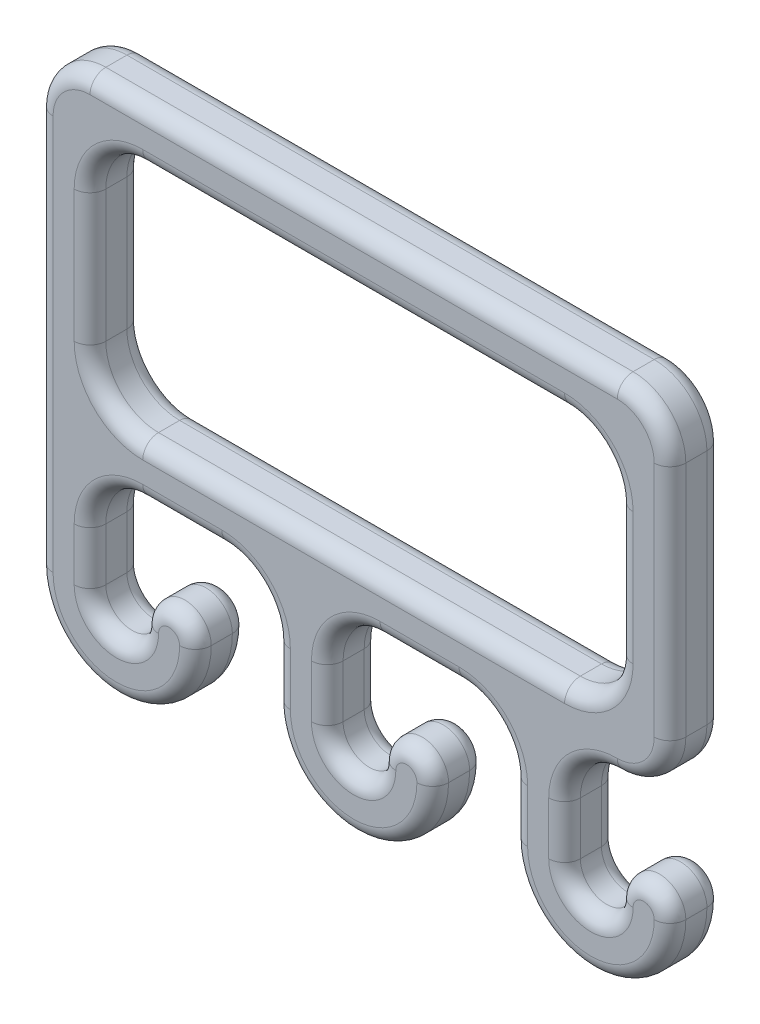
ISO-10303-21;
HEADER;
FILE_DESCRIPTION(('STEP AP214'),'2;1');
FILE_NAME('part.step','',(''),(''),'','','');
FILE_SCHEMA(('AUTOMOTIVE_DESIGN { 1 0 10303 214 1 1 1 1 }'));
ENDSEC;
DATA;
#1=APPLICATION_CONTEXT('core data for automotive mechanical design processes');
#2=APPLICATION_PROTOCOL_DEFINITION('international standard','automotive_design',2000,#1);
#3=PRODUCT_CONTEXT('',#1,'mechanical');
#4=PRODUCT('Part','Part','',(#3));
#5=PRODUCT_RELATED_PRODUCT_CATEGORY('part','',(#4));
#6=PRODUCT_DEFINITION_FORMATION('','',#4);
#7=PRODUCT_DEFINITION_CONTEXT('part definition',#1,'design');
#8=PRODUCT_DEFINITION('design','',#6,#7);
#9=PRODUCT_DEFINITION_SHAPE('','',#8);
#10=(LENGTH_UNIT() NAMED_UNIT(*) SI_UNIT(.MILLI.,.METRE.));
#11=(NAMED_UNIT(*) PLANE_ANGLE_UNIT() SI_UNIT($,.RADIAN.));
#12=(NAMED_UNIT(*) SI_UNIT($,.STERADIAN.) SOLID_ANGLE_UNIT());
#13=UNCERTAINTY_MEASURE_WITH_UNIT(LENGTH_MEASURE(1.E-05),#10,'distance_accuracy_value','');
#14=(GEOMETRIC_REPRESENTATION_CONTEXT(3) GLOBAL_UNCERTAINTY_ASSIGNED_CONTEXT((#13)) GLOBAL_UNIT_ASSIGNED_CONTEXT((#10,
#11,#12)) REPRESENTATION_CONTEXT('',''));
#15=CARTESIAN_POINT('',(0.,0.,0.));
#16=DIRECTION('',(0.,0.,1.));
#17=DIRECTION('',(1.,0.,0.));
#18=AXIS2_PLACEMENT_3D('',#15,#16,#17);
#19=CARTESIAN_POINT('',(100.,-116.640392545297,10.));
#20=DIRECTION('',(-1.,0.,0.));
#21=DIRECTION('',(0.,0.,1.));
#22=AXIS2_PLACEMENT_3D('',#19,#20,#21);
#23=PLANE('',#22);
#24=DIRECTION('',(0.,0.,-1.));
#25=VECTOR('',#24,1.);
#26=CARTESIAN_POINT('',(100.,35.,10.));
#27=LINE('',#26,#25);
#28=CARTESIAN_POINT('',(100.,35.,7.));
#29=VERTEX_POINT('',#28);
#30=CARTESIAN_POINT('',(100.,35.,3.));
#31=VERTEX_POINT('',#30);
#32=EDGE_CURVE('E999',#29,#31,#27,.T.);
#33=ORIENTED_EDGE('',*,*,#32,.T.);
#34=DIRECTION('',(0.,1.,0.));
#35=VECTOR('',#34,1.);
#36=CARTESIAN_POINT('',(100.,10.,3.));
#37=LINE('',#36,#35);
#38=CARTESIAN_POINT('',(100.,10.,3.));
#39=VERTEX_POINT('',#38);
#40=EDGE_CURVE('E774',#31,#39,#37,.F.);
#41=ORIENTED_EDGE('',*,*,#40,.T.);
#42=DIRECTION('',(0.,0.,-1.));
#43=VECTOR('',#42,1.);
#44=CARTESIAN_POINT('',(100.,10.,10.));
#45=LINE('',#44,#43);
#46=CARTESIAN_POINT('',(100.,10.,7.));
#47=VERTEX_POINT('',#46);
#48=EDGE_CURVE('E992',#39,#47,#45,.F.);
#49=ORIENTED_EDGE('',*,*,#48,.T.);
#50=DIRECTION('',(0.,1.,0.));
#51=VECTOR('',#50,1.);
#52=CARTESIAN_POINT('',(100.,-116.640392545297,7.));
#53=LINE('',#52,#51);
#54=EDGE_CURVE('E772',#47,#29,#53,.T.);
#55=ORIENTED_EDGE('',*,*,#54,.T.);
#56=EDGE_LOOP('',(#33,#41,#49,#55));
#57=FACE_BOUND('',#56,.T.);
#58=ADVANCED_FACE('F35',(#57),#23,.T.);
#59=CARTESIAN_POINT('',(50.,0.,10.));
#60=DIRECTION('',(0.,1.,0.));
#61=DIRECTION('',(0.,0.,1.));
#62=AXIS2_PLACEMENT_3D('',#59,#60,#61);
#63=PLANE('',#62);
#64=DIRECTION('',(0.,0.,-1.));
#65=VECTOR('',#64,1.);
#66=CARTESIAN_POINT('',(90.,0.,0.));
#67=LINE('',#66,#65);
#68=CARTESIAN_POINT('',(90.,0.,7.));
#69=VERTEX_POINT('',#68);
#70=CARTESIAN_POINT('',(90.,0.,3.));
#71=VERTEX_POINT('',#70);
#72=EDGE_CURVE('E995',#69,#71,#67,.T.);
#73=ORIENTED_EDGE('',*,*,#72,.T.);
#74=DIRECTION('',(1.,0.,0.));
#75=VECTOR('',#74,1.);
#76=CARTESIAN_POINT('',(10.,0.,3.));
#77=LINE('',#76,#75);
#78=CARTESIAN_POINT('',(10.,0.,3.));
#79=VERTEX_POINT('',#78);
#80=EDGE_CURVE('E766',#71,#79,#77,.F.);
#81=ORIENTED_EDGE('',*,*,#80,.T.);
#82=DIRECTION('',(0.,0.,-1.));
#83=VECTOR('',#82,1.);
#84=CARTESIAN_POINT('',(10.,0.,10.));
#85=LINE('',#84,#83);
#86=CARTESIAN_POINT('',(10.,0.,7.));
#87=VERTEX_POINT('',#86);
#88=EDGE_CURVE('E1012',#79,#87,#85,.F.);
#89=ORIENTED_EDGE('',*,*,#88,.T.);
#90=DIRECTION('',(1.,0.,0.));
#91=VECTOR('',#90,1.);
#92=CARTESIAN_POINT('',(50.,0.,7.));
#93=LINE('',#92,#91);
#94=EDGE_CURVE('E764',#87,#69,#93,.T.);
#95=ORIENTED_EDGE('',*,*,#94,.T.);
#96=EDGE_LOOP('',(#73,#81,#89,#95));
#97=FACE_BOUND('',#96,.T.);
#98=ADVANCED_FACE('F1406',(#97),#63,.T.);
#99=CARTESIAN_POINT('',(0.,-116.640392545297,10.));
#100=DIRECTION('',(-1.,0.,0.));
#101=DIRECTION('',(0.,0.,1.));
#102=AXIS2_PLACEMENT_3D('',#99,#100,#101);
#103=PLANE('',#102);
#104=DIRECTION('',(0.,0.,-1.));
#105=VECTOR('',#104,1.);
#106=CARTESIAN_POINT('',(0.,10.,10.));
#107=LINE('',#106,#105);
#108=CARTESIAN_POINT('',(0.,10.,7.));
#109=VERTEX_POINT('',#108);
#110=CARTESIAN_POINT('',(0.,10.,3.));
#111=VERTEX_POINT('',#110);
#112=EDGE_CURVE('E1019',#109,#111,#107,.T.);
#113=ORIENTED_EDGE('',*,*,#112,.T.);
#114=DIRECTION('',(0.,1.,0.));
#115=VECTOR('',#114,1.);
#116=CARTESIAN_POINT('',(0.,-116.640392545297,3.));
#117=LINE('',#116,#115);
#118=CARTESIAN_POINT('',(0.,35.,3.));
#119=VERTEX_POINT('',#118);
#120=EDGE_CURVE('E758',#111,#119,#117,.T.);
#121=ORIENTED_EDGE('',*,*,#120,.T.);
#122=DIRECTION('',(0.,0.,-1.));
#123=VECTOR('',#122,1.);
#124=CARTESIAN_POINT('',(0.,35.,10.));
#125=LINE('',#124,#123);
#126=CARTESIAN_POINT('',(0.,35.,7.));
#127=VERTEX_POINT('',#126);
#128=EDGE_CURVE('E1016',#119,#127,#125,.F.);
#129=ORIENTED_EDGE('',*,*,#128,.T.);
#130=DIRECTION('',(0.,1.,0.));
#131=VECTOR('',#130,1.);
#132=CARTESIAN_POINT('',(0.,10.,7.));
#133=LINE('',#132,#131);
#134=EDGE_CURVE('E756',#127,#109,#133,.F.);
#135=ORIENTED_EDGE('',*,*,#134,.T.);
#136=EDGE_LOOP('',(#113,#121,#129,#135));
#137=FACE_BOUND('',#136,.T.);
#138=ADVANCED_FACE('F1411',(#137),#103,.F.);
#139=CARTESIAN_POINT('',(-10.,-116.640392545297,10.));
#140=DIRECTION('',(-1.,0.,0.));
#141=DIRECTION('',(0.,0.,1.));
#142=AXIS2_PLACEMENT_3D('',#139,#140,#141);
#143=PLANE('',#142);
#144=DIRECTION('',(0.,0.,-1.));
#145=VECTOR('',#144,1.);
#146=CARTESIAN_POINT('',(-10.,45.,10.));
#147=LINE('',#146,#145);
#148=CARTESIAN_POINT('',(-10.,45.,7.));
#149=VERTEX_POINT('',#148);
#150=CARTESIAN_POINT('',(-10.,45.,3.));
#151=VERTEX_POINT('',#150);
#152=EDGE_CURVE('E498',#149,#151,#147,.T.);
#153=ORIENTED_EDGE('',*,*,#152,.T.);
#154=DIRECTION('',(0.,1.,0.));
#155=VECTOR('',#154,1.);
#156=CARTESIAN_POINT('',(-10.,-30.,3.));
#157=LINE('',#156,#155);
#158=CARTESIAN_POINT('',(-10.,-30.,3.));
#159=VERTEX_POINT('',#158);
#160=EDGE_CURVE('E580',#151,#159,#157,.F.);
#161=ORIENTED_EDGE('',*,*,#160,.T.);
#162=DIRECTION('',(0.,0.,-1.));
#163=VECTOR('',#162,1.);
#164=CARTESIAN_POINT('',(-10.,-30.,10.));
#165=LINE('',#164,#163);
#166=CARTESIAN_POINT('',(-10.,-30.,7.));
#167=VERTEX_POINT('',#166);
#168=EDGE_CURVE('E1000',#167,#159,#165,.T.);
#169=ORIENTED_EDGE('',*,*,#168,.F.);
#170=DIRECTION('',(0.,1.,0.));
#171=VECTOR('',#170,1.);
#172=CARTESIAN_POINT('',(-10.,-116.640392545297,7.));
#173=LINE('',#172,#171);
#174=EDGE_CURVE('E578',#167,#149,#173,.T.);
#175=ORIENTED_EDGE('',*,*,#174,.T.);
#176=EDGE_LOOP('',(#153,#161,#169,#175));
#177=FACE_BOUND('',#176,.T.);
#178=ADVANCED_FACE('F1087',(#177),#143,.T.);
#179=CARTESIAN_POINT('',(5.,-30.,10.));
#180=DIRECTION('',(0.,0.,-1.));
#181=DIRECTION('',(-1.,0.,0.));
#182=AXIS2_PLACEMENT_3D('',#179,#180,#181);
#183=CYLINDRICAL_SURFACE('',#182,15.);
#184=ORIENTED_EDGE('',*,*,#168,.T.);
#185=CARTESIAN_POINT('',(5.,-30.,3.));
#186=DIRECTION('',(0.,0.,1.));
#187=DIRECTION('',(1.,0.,0.));
#188=AXIS2_PLACEMENT_3D('',#185,#186,#187);
#189=CIRCLE('',#188,15.);
#190=CARTESIAN_POINT('',(20.,-30.,3.));
#191=VERTEX_POINT('',#190);
#192=EDGE_CURVE('E584',#159,#191,#189,.T.);
#193=ORIENTED_EDGE('',*,*,#192,.T.);
#194=DIRECTION('',(0.,0.,-1.));
#195=VECTOR('',#194,1.);
#196=CARTESIAN_POINT('',(20.,-30.,10.));
#197=LINE('',#196,#195);
#198=CARTESIAN_POINT('',(20.,-30.,7.));
#199=VERTEX_POINT('',#198);
#200=EDGE_CURVE('E1005',#199,#191,#197,.T.);
#201=ORIENTED_EDGE('',*,*,#200,.F.);
#202=CARTESIAN_POINT('',(5.,-30.,7.));
#203=DIRECTION('',(0.,0.,1.));
#204=DIRECTION('',(1.,0.,0.));
#205=AXIS2_PLACEMENT_3D('',#202,#203,#204);
#206=CIRCLE('',#205,15.);
#207=EDGE_CURVE('E582',#199,#167,#206,.F.);
#208=ORIENTED_EDGE('',*,*,#207,.T.);
#209=EDGE_LOOP('',(#184,#193,#201,#208));
#210=FACE_BOUND('',#209,.T.);
#211=ADVANCED_FACE('F1449',(#210),#183,.T.);
#212=CARTESIAN_POINT('',(15.,-30.,10.));
#213=DIRECTION('',(0.,0.,-1.));
#214=DIRECTION('',(-1.,0.,0.));
#215=AXIS2_PLACEMENT_3D('',#212,#213,#214);
#216=CYLINDRICAL_SURFACE('',#215,4.99999999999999);
#217=ORIENTED_EDGE('',*,*,#200,.T.);
#218=CARTESIAN_POINT('',(15.,-30.,3.));
#219=DIRECTION('',(0.,0.,1.));
#220=DIRECTION('',(1.,0.,0.));
#221=AXIS2_PLACEMENT_3D('',#218,#219,#220);
#222=CIRCLE('',#221,4.99999999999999);
#223=CARTESIAN_POINT('',(10.,-30.,3.));
#224=VERTEX_POINT('',#223);
#225=EDGE_CURVE('E588',#191,#224,#222,.T.);
#226=ORIENTED_EDGE('',*,*,#225,.T.);
#227=DIRECTION('',(0.,0.,-1.));
#228=VECTOR('',#227,1.);
#229=CARTESIAN_POINT('',(10.,-30.,10.));
#230=LINE('',#229,#228);
#231=CARTESIAN_POINT('',(10.,-30.,7.));
#232=VERTEX_POINT('',#231);
#233=EDGE_CURVE('E1251',#232,#224,#230,.T.);
#234=ORIENTED_EDGE('',*,*,#233,.F.);
#235=CARTESIAN_POINT('',(15.,-30.,7.));
#236=DIRECTION('',(0.,0.,1.));
#237=DIRECTION('',(1.,0.,0.));
#238=AXIS2_PLACEMENT_3D('',#235,#236,#237);
#239=CIRCLE('',#238,4.99999999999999);
#240=EDGE_CURVE('E586',#232,#199,#239,.F.);
#241=ORIENTED_EDGE('',*,*,#240,.T.);
#242=EDGE_LOOP('',(#217,#226,#234,#241));
#243=FACE_BOUND('',#242,.T.);
#244=ADVANCED_FACE('F1257',(#243),#216,.T.);
#245=CARTESIAN_POINT('',(5.,-30.,10.));
#246=DIRECTION('',(0.,0.,-1.));
#247=DIRECTION('',(-1.,0.,0.));
#248=AXIS2_PLACEMENT_3D('',#245,#246,#247);
#249=CYLINDRICAL_SURFACE('',#248,5.);
#250=ORIENTED_EDGE('',*,*,#233,.T.);
#251=CARTESIAN_POINT('',(5.,-30.,3.));
#252=DIRECTION('',(0.,0.,1.));
#253=DIRECTION('',(1.,0.,0.));
#254=AXIS2_PLACEMENT_3D('',#251,#252,#253);
#255=CIRCLE('',#254,5.);
#256=CARTESIAN_POINT('',(0.,-30.,3.));
#257=VERTEX_POINT('',#256);
#258=EDGE_CURVE('E592',#224,#257,#255,.F.);
#259=ORIENTED_EDGE('',*,*,#258,.T.);
#260=DIRECTION('',(0.,0.,-1.));
#261=VECTOR('',#260,1.);
#262=CARTESIAN_POINT('',(0.,-30.,10.));
#263=LINE('',#262,#261);
#264=CARTESIAN_POINT('',(0.,-30.,7.));
#265=VERTEX_POINT('',#264);
#266=EDGE_CURVE('E1248',#265,#257,#263,.T.);
#267=ORIENTED_EDGE('',*,*,#266,.F.);
#268=CARTESIAN_POINT('',(5.,-30.,7.));
#269=DIRECTION('',(0.,0.,1.));
#270=DIRECTION('',(1.,0.,0.));
#271=AXIS2_PLACEMENT_3D('',#268,#269,#270);
#272=CIRCLE('',#271,5.);
#273=EDGE_CURVE('E590',#265,#232,#272,.T.);
#274=ORIENTED_EDGE('',*,*,#273,.T.);
#275=EDGE_LOOP('',(#250,#259,#267,#274));
#276=FACE_BOUND('',#275,.T.);
#277=ADVANCED_FACE('F1282',(#276),#249,.F.);
#278=CARTESIAN_POINT('',(0.,-116.640392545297,10.));
#279=DIRECTION('',(1.,0.,0.));
#280=DIRECTION('',(0.,1.,0.));
#281=AXIS2_PLACEMENT_3D('',#278,#279,#280);
#282=PLANE('',#281);
#283=ORIENTED_EDGE('',*,*,#266,.T.);
#284=DIRECTION('',(0.,-1.,0.));
#285=VECTOR('',#284,1.);
#286=CARTESIAN_POINT('',(0.,-20.,3.));
#287=LINE('',#286,#285);
#288=CARTESIAN_POINT('',(0.,-20.,3.));
#289=VERTEX_POINT('',#288);
#290=EDGE_CURVE('E596',#257,#289,#287,.F.);
#291=ORIENTED_EDGE('',*,*,#290,.T.);
#292=DIRECTION('',(0.,0.,-1.));
#293=VECTOR('',#292,1.);
#294=CARTESIAN_POINT('',(0.,-20.,10.));
#295=LINE('',#294,#293);
#296=CARTESIAN_POINT('',(0.,-20.,7.));
#297=VERTEX_POINT('',#296);
#298=EDGE_CURVE('E1046',#289,#297,#295,.F.);
#299=ORIENTED_EDGE('',*,*,#298,.T.);
#300=DIRECTION('',(0.,-1.,0.));
#301=VECTOR('',#300,1.);
#302=CARTESIAN_POINT('',(0.,-116.640392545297,7.));
#303=LINE('',#302,#301);
#304=EDGE_CURVE('E594',#297,#265,#303,.T.);
#305=ORIENTED_EDGE('',*,*,#304,.T.);
#306=EDGE_LOOP('',(#283,#291,#299,#305));
#307=FACE_BOUND('',#306,.T.);
#308=ADVANCED_FACE('F1286',(#307),#282,.T.);
#309=CARTESIAN_POINT('',(50.,-9.99999999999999,10.));
#310=DIRECTION('',(0.,1.,0.));
#311=DIRECTION('',(0.,0.,1.));
#312=AXIS2_PLACEMENT_3D('',#309,#310,#311);
#313=PLANE('',#312);
#314=DIRECTION('',(0.,0.,-1.));
#315=VECTOR('',#314,1.);
#316=CARTESIAN_POINT('',(10.,-9.99999999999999,10.));
#317=LINE('',#316,#315);
#318=CARTESIAN_POINT('',(10.,-9.99999999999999,7.));
#319=VERTEX_POINT('',#318);
#320=CARTESIAN_POINT('',(10.,-9.99999999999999,3.));
#321=VERTEX_POINT('',#320);
#322=EDGE_CURVE('E1025',#319,#321,#317,.T.);
#323=ORIENTED_EDGE('',*,*,#322,.T.);
#324=DIRECTION('',(1.,0.,0.));
#325=VECTOR('',#324,1.);
#326=CARTESIAN_POINT('',(50.,-9.99999999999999,3.));
#327=LINE('',#326,#325);
#328=CARTESIAN_POINT('',(25.,-9.99999999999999,3.));
#329=VERTEX_POINT('',#328);
#330=EDGE_CURVE('E604',#321,#329,#327,.T.);
#331=ORIENTED_EDGE('',*,*,#330,.T.);
#332=DIRECTION('',(0.,0.,-1.));
#333=VECTOR('',#332,1.);
#334=CARTESIAN_POINT('',(25.,-9.99999999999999,10.));
#335=LINE('',#334,#333);
#336=CARTESIAN_POINT('',(25.,-9.99999999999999,7.));
#337=VERTEX_POINT('',#336);
#338=EDGE_CURVE('E1028',#329,#337,#335,.F.);
#339=ORIENTED_EDGE('',*,*,#338,.T.);
#340=DIRECTION('',(1.,0.,0.));
#341=VECTOR('',#340,1.);
#342=CARTESIAN_POINT('',(10.,-9.99999999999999,7.));
#343=LINE('',#342,#341);
#344=EDGE_CURVE('E602',#337,#319,#343,.F.);
#345=ORIENTED_EDGE('',*,*,#344,.T.);
#346=EDGE_LOOP('',(#323,#331,#339,#345));
#347=FACE_BOUND('',#346,.T.);
#348=ADVANCED_FACE('F1303',(#347),#313,.F.);
#349=CARTESIAN_POINT('',(35.,-116.640392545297,10.));
#350=DIRECTION('',(1.,0.,0.));
#351=DIRECTION('',(0.,1.,0.));
#352=AXIS2_PLACEMENT_3D('',#349,#350,#351);
#353=PLANE('',#352);
#354=DIRECTION('',(0.,0.,-1.));
#355=VECTOR('',#354,1.);
#356=CARTESIAN_POINT('',(35.,-20.,0.));
#357=LINE('',#356,#355);
#358=CARTESIAN_POINT('',(35.,-20.,7.));
#359=VERTEX_POINT('',#358);
#360=CARTESIAN_POINT('',(35.,-20.,3.));
#361=VERTEX_POINT('',#360);
#362=EDGE_CURVE('E1022',#359,#361,#357,.T.);
#363=ORIENTED_EDGE('',*,*,#362,.T.);
#364=DIRECTION('',(0.,-1.,0.));
#365=VECTOR('',#364,1.);
#366=CARTESIAN_POINT('',(35.,-116.640392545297,3.));
#367=LINE('',#366,#365);
#368=CARTESIAN_POINT('',(35.,-30.,3.));
#369=VERTEX_POINT('',#368);
#370=EDGE_CURVE('E612',#361,#369,#367,.T.);
#371=ORIENTED_EDGE('',*,*,#370,.T.);
#372=DIRECTION('',(0.,0.,-1.));
#373=VECTOR('',#372,1.);
#374=CARTESIAN_POINT('',(35.,-30.,10.));
#375=LINE('',#374,#373);
#376=CARTESIAN_POINT('',(35.,-30.,7.));
#377=VERTEX_POINT('',#376);
#378=EDGE_CURVE('E1245',#377,#369,#375,.T.);
#379=ORIENTED_EDGE('',*,*,#378,.F.);
#380=DIRECTION('',(0.,-1.,0.));
#381=VECTOR('',#380,1.);
#382=CARTESIAN_POINT('',(35.,-20.,7.));
#383=LINE('',#382,#381);
#384=EDGE_CURVE('E610',#377,#359,#383,.F.);
#385=ORIENTED_EDGE('',*,*,#384,.T.);
#386=EDGE_LOOP('',(#363,#371,#379,#385));
#387=FACE_BOUND('',#386,.T.);
#388=ADVANCED_FACE('F1321',(#387),#353,.F.);
#389=CARTESIAN_POINT('',(50.,-30.,10.));
#390=DIRECTION('',(0.,0.,-1.));
#391=DIRECTION('',(-1.,0.,0.));
#392=AXIS2_PLACEMENT_3D('',#389,#390,#391);
#393=CYLINDRICAL_SURFACE('',#392,15.);
#394=ORIENTED_EDGE('',*,*,#378,.T.);
#395=CARTESIAN_POINT('',(50.,-30.,3.));
#396=DIRECTION('',(0.,0.,1.));
#397=DIRECTION('',(1.,0.,0.));
#398=AXIS2_PLACEMENT_3D('',#395,#396,#397);
#399=CIRCLE('',#398,15.);
#400=CARTESIAN_POINT('',(65.,-30.,3.));
#401=VERTEX_POINT('',#400);
#402=EDGE_CURVE('E616',#369,#401,#399,.T.);
#403=ORIENTED_EDGE('',*,*,#402,.T.);
#404=DIRECTION('',(0.,0.,-1.));
#405=VECTOR('',#404,1.);
#406=CARTESIAN_POINT('',(65.,-30.,10.));
#407=LINE('',#406,#405);
#408=CARTESIAN_POINT('',(65.,-30.,7.));
#409=VERTEX_POINT('',#408);
#410=EDGE_CURVE('E1239',#409,#401,#407,.T.);
#411=ORIENTED_EDGE('',*,*,#410,.F.);
#412=CARTESIAN_POINT('',(50.,-30.,7.));
#413=DIRECTION('',(0.,0.,1.));
#414=DIRECTION('',(1.,0.,0.));
#415=AXIS2_PLACEMENT_3D('',#412,#413,#414);
#416=CIRCLE('',#415,15.);
#417=EDGE_CURVE('E614',#409,#377,#416,.F.);
#418=ORIENTED_EDGE('',*,*,#417,.T.);
#419=EDGE_LOOP('',(#394,#403,#411,#418));
#420=FACE_BOUND('',#419,.T.);
#421=ADVANCED_FACE('F1335',(#420),#393,.T.);
#422=CARTESIAN_POINT('',(60.,-30.,10.));
#423=DIRECTION('',(0.,0.,-1.));
#424=DIRECTION('',(-1.,0.,0.));
#425=AXIS2_PLACEMENT_3D('',#422,#423,#424);
#426=CYLINDRICAL_SURFACE('',#425,5.);
#427=ORIENTED_EDGE('',*,*,#410,.T.);
#428=CARTESIAN_POINT('',(60.,-30.,3.));
#429=DIRECTION('',(0.,0.,1.));
#430=DIRECTION('',(1.,0.,0.));
#431=AXIS2_PLACEMENT_3D('',#428,#429,#430);
#432=CIRCLE('',#431,5.);
#433=CARTESIAN_POINT('',(55.,-30.,3.));
#434=VERTEX_POINT('',#433);
#435=EDGE_CURVE('E620',#401,#434,#432,.T.);
#436=ORIENTED_EDGE('',*,*,#435,.T.);
#437=DIRECTION('',(0.,0.,-1.));
#438=VECTOR('',#437,1.);
#439=CARTESIAN_POINT('',(55.,-30.,10.));
#440=LINE('',#439,#438);
#441=CARTESIAN_POINT('',(55.,-30.,7.));
#442=VERTEX_POINT('',#441);
#443=EDGE_CURVE('E1237',#442,#434,#440,.T.);
#444=ORIENTED_EDGE('',*,*,#443,.F.);
#445=CARTESIAN_POINT('',(60.,-30.,7.));
#446=DIRECTION('',(0.,0.,1.));
#447=DIRECTION('',(1.,0.,0.));
#448=AXIS2_PLACEMENT_3D('',#445,#446,#447);
#449=CIRCLE('',#448,5.);
#450=EDGE_CURVE('E618',#442,#409,#449,.F.);
#451=ORIENTED_EDGE('',*,*,#450,.T.);
#452=EDGE_LOOP('',(#427,#436,#444,#451));
#453=FACE_BOUND('',#452,.T.);
#454=ADVANCED_FACE('F1339',(#453),#426,.T.);
#455=CARTESIAN_POINT('',(50.,-30.,10.));
#456=DIRECTION('',(0.,0.,-1.));
#457=DIRECTION('',(-1.,0.,0.));
#458=AXIS2_PLACEMENT_3D('',#455,#456,#457);
#459=CYLINDRICAL_SURFACE('',#458,5.);
#460=ORIENTED_EDGE('',*,*,#443,.T.);
#461=CARTESIAN_POINT('',(50.,-30.,3.));
#462=DIRECTION('',(0.,0.,1.));
#463=DIRECTION('',(1.,0.,0.));
#464=AXIS2_PLACEMENT_3D('',#461,#462,#463);
#465=CIRCLE('',#464,5.);
#466=CARTESIAN_POINT('',(45.,-30.,3.));
#467=VERTEX_POINT('',#466);
#468=EDGE_CURVE('E624',#434,#467,#465,.F.);
#469=ORIENTED_EDGE('',*,*,#468,.T.);
#470=DIRECTION('',(0.,0.,-1.));
#471=VECTOR('',#470,1.);
#472=CARTESIAN_POINT('',(45.,-30.,10.));
#473=LINE('',#472,#471);
#474=CARTESIAN_POINT('',(45.,-30.,7.));
#475=VERTEX_POINT('',#474);
#476=EDGE_CURVE('E1230',#475,#467,#473,.T.);
#477=ORIENTED_EDGE('',*,*,#476,.F.);
#478=CARTESIAN_POINT('',(50.,-30.,7.));
#479=DIRECTION('',(0.,0.,1.));
#480=DIRECTION('',(1.,0.,0.));
#481=AXIS2_PLACEMENT_3D('',#478,#479,#480);
#482=CIRCLE('',#481,5.);
#483=EDGE_CURVE('E622',#475,#442,#482,.T.);
#484=ORIENTED_EDGE('',*,*,#483,.T.);
#485=EDGE_LOOP('',(#460,#469,#477,#484));
#486=FACE_BOUND('',#485,.T.);
#487=ADVANCED_FACE('F1234',(#486),#459,.F.);
#488=CARTESIAN_POINT('',(45.,-116.640392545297,10.));
#489=DIRECTION('',(1.,0.,0.));
#490=DIRECTION('',(0.,0.,-1.));
#491=AXIS2_PLACEMENT_3D('',#488,#489,#490);
#492=PLANE('',#491);
#493=ORIENTED_EDGE('',*,*,#476,.T.);
#494=DIRECTION('',(0.,-1.,0.));
#495=VECTOR('',#494,1.);
#496=CARTESIAN_POINT('',(45.,-20.,3.));
#497=LINE('',#496,#495);
#498=CARTESIAN_POINT('',(45.,-20.,3.));
#499=VERTEX_POINT('',#498);
#500=EDGE_CURVE('E628',#467,#499,#497,.F.);
#501=ORIENTED_EDGE('',*,*,#500,.T.);
#502=DIRECTION('',(0.,0.,-1.));
#503=VECTOR('',#502,1.);
#504=CARTESIAN_POINT('',(45.,-20.,10.));
#505=LINE('',#504,#503);
#506=CARTESIAN_POINT('',(45.,-20.,7.));
#507=VERTEX_POINT('',#506);
#508=EDGE_CURVE('E1043',#499,#507,#505,.F.);
#509=ORIENTED_EDGE('',*,*,#508,.T.);
#510=DIRECTION('',(0.,-1.,0.));
#511=VECTOR('',#510,1.);
#512=CARTESIAN_POINT('',(45.,-116.640392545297,7.));
#513=LINE('',#512,#511);
#514=EDGE_CURVE('E626',#507,#475,#513,.T.);
#515=ORIENTED_EDGE('',*,*,#514,.T.);
#516=EDGE_LOOP('',(#493,#501,#509,#515));
#517=FACE_BOUND('',#516,.T.);
#518=ADVANCED_FACE('F1229',(#517),#492,.T.);
#519=DIRECTION('',(0.,0.,-1.));
#520=VECTOR('',#519,1.);
#521=CARTESIAN_POINT('',(55.,-9.99999999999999,10.));
#522=LINE('',#521,#520);
#523=CARTESIAN_POINT('',(55.,-9.99999999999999,7.));
#524=VERTEX_POINT('',#523);
#525=CARTESIAN_POINT('',(55.,-9.99999999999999,3.));
#526=VERTEX_POINT('',#525);
#527=EDGE_CURVE('E1034',#524,#526,#522,.T.);
#528=ORIENTED_EDGE('',*,*,#527,.T.);
#529=DIRECTION('',(1.,0.,0.));
#530=VECTOR('',#529,1.);
#531=CARTESIAN_POINT('',(50.,-9.99999999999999,3.));
#532=LINE('',#531,#530);
#533=CARTESIAN_POINT('',(70.,-9.99999999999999,3.));
#534=VERTEX_POINT('',#533);
#535=EDGE_CURVE('E636',#526,#534,#532,.T.);
#536=ORIENTED_EDGE('',*,*,#535,.T.);
#537=DIRECTION('',(0.,0.,-1.));
#538=VECTOR('',#537,1.);
#539=CARTESIAN_POINT('',(70.,-9.99999999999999,10.));
#540=LINE('',#539,#538);
#541=CARTESIAN_POINT('',(70.,-9.99999999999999,7.));
#542=VERTEX_POINT('',#541);
#543=EDGE_CURVE('E1037',#534,#542,#540,.F.);
#544=ORIENTED_EDGE('',*,*,#543,.T.);
#545=DIRECTION('',(1.,0.,0.));
#546=VECTOR('',#545,1.);
#547=CARTESIAN_POINT('',(55.,-9.99999999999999,7.));
#548=LINE('',#547,#546);
#549=EDGE_CURVE('E634',#542,#524,#548,.F.);
#550=ORIENTED_EDGE('',*,*,#549,.T.);
#551=EDGE_LOOP('',(#528,#536,#544,#550));
#552=FACE_BOUND('',#551,.T.);
#553=ADVANCED_FACE('F1209',(#552),#313,.F.);
#554=CARTESIAN_POINT('',(80.,-116.640392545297,10.));
#555=DIRECTION('',(1.,0.,0.));
#556=DIRECTION('',(0.,0.,-1.));
#557=AXIS2_PLACEMENT_3D('',#554,#555,#556);
#558=PLANE('',#557);
#559=DIRECTION('',(0.,0.,-1.));
#560=VECTOR('',#559,1.);
#561=CARTESIAN_POINT('',(80.,-20.,0.));
#562=LINE('',#561,#560);
#563=CARTESIAN_POINT('',(80.,-20.,7.));
#564=VERTEX_POINT('',#563);
#565=CARTESIAN_POINT('',(80.,-20.,3.));
#566=VERTEX_POINT('',#565);
#567=EDGE_CURVE('E1031',#564,#566,#562,.T.);
#568=ORIENTED_EDGE('',*,*,#567,.T.);
#569=DIRECTION('',(0.,-1.,0.));
#570=VECTOR('',#569,1.);
#571=CARTESIAN_POINT('',(80.,-116.640392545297,3.));
#572=LINE('',#571,#570);
#573=CARTESIAN_POINT('',(80.,-30.,3.));
#574=VERTEX_POINT('',#573);
#575=EDGE_CURVE('E644',#566,#574,#572,.T.);
#576=ORIENTED_EDGE('',*,*,#575,.T.);
#577=DIRECTION('',(0.,0.,-1.));
#578=VECTOR('',#577,1.);
#579=CARTESIAN_POINT('',(80.,-30.,10.));
#580=LINE('',#579,#578);
#581=CARTESIAN_POINT('',(80.,-30.,7.));
#582=VERTEX_POINT('',#581);
#583=EDGE_CURVE('E1178',#582,#574,#580,.T.);
#584=ORIENTED_EDGE('',*,*,#583,.F.);
#585=DIRECTION('',(0.,-1.,0.));
#586=VECTOR('',#585,1.);
#587=CARTESIAN_POINT('',(80.,-20.,7.));
#588=LINE('',#587,#586);
#589=EDGE_CURVE('E642',#582,#564,#588,.F.);
#590=ORIENTED_EDGE('',*,*,#589,.T.);
#591=EDGE_LOOP('',(#568,#576,#584,#590));
#592=FACE_BOUND('',#591,.T.);
#593=ADVANCED_FACE('F1191',(#592),#558,.F.);
#594=CARTESIAN_POINT('',(95.,-30.,10.));
#595=DIRECTION('',(0.,0.,-1.));
#596=DIRECTION('',(-1.,0.,0.));
#597=AXIS2_PLACEMENT_3D('',#594,#595,#596);
#598=CYLINDRICAL_SURFACE('',#597,15.);
#599=ORIENTED_EDGE('',*,*,#583,.T.);
#600=CARTESIAN_POINT('',(95.,-30.,3.));
#601=DIRECTION('',(0.,0.,1.));
#602=DIRECTION('',(1.,0.,0.));
#603=AXIS2_PLACEMENT_3D('',#600,#601,#602);
#604=CIRCLE('',#603,15.);
#605=CARTESIAN_POINT('',(110.,-30.,3.));
#606=VERTEX_POINT('',#605);
#607=EDGE_CURVE('E648',#574,#606,#604,.T.);
#608=ORIENTED_EDGE('',*,*,#607,.T.);
#609=DIRECTION('',(0.,0.,-1.));
#610=VECTOR('',#609,1.);
#611=CARTESIAN_POINT('',(110.,-30.,10.));
#612=LINE('',#611,#610);
#613=CARTESIAN_POINT('',(110.,-30.,7.));
#614=VERTEX_POINT('',#613);
#615=EDGE_CURVE('E1170',#614,#606,#612,.T.);
#616=ORIENTED_EDGE('',*,*,#615,.F.);
#617=CARTESIAN_POINT('',(95.,-30.,7.));
#618=DIRECTION('',(0.,0.,1.));
#619=DIRECTION('',(1.,0.,0.));
#620=AXIS2_PLACEMENT_3D('',#617,#618,#619);
#621=CIRCLE('',#620,15.);
#622=EDGE_CURVE('E646',#614,#582,#621,.F.);
#623=ORIENTED_EDGE('',*,*,#622,.T.);
#624=EDGE_LOOP('',(#599,#608,#616,#623));
#625=FACE_BOUND('',#624,.T.);
#626=ADVANCED_FACE('F1175',(#625),#598,.T.);
#627=CARTESIAN_POINT('',(105.,-30.,10.));
#628=DIRECTION('',(0.,0.,-1.));
#629=DIRECTION('',(-1.,0.,0.));
#630=AXIS2_PLACEMENT_3D('',#627,#628,#629);
#631=CYLINDRICAL_SURFACE('',#630,4.99999999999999);
#632=ORIENTED_EDGE('',*,*,#615,.T.);
#633=CARTESIAN_POINT('',(105.,-30.,3.));
#634=DIRECTION('',(0.,0.,1.));
#635=DIRECTION('',(1.,0.,0.));
#636=AXIS2_PLACEMENT_3D('',#633,#634,#635);
#637=CIRCLE('',#636,4.99999999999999);
#638=CARTESIAN_POINT('',(100.,-30.,3.));
#639=VERTEX_POINT('',#638);
#640=EDGE_CURVE('E652',#606,#639,#637,.T.);
#641=ORIENTED_EDGE('',*,*,#640,.T.);
#642=DIRECTION('',(0.,0.,-1.));
#643=VECTOR('',#642,1.);
#644=CARTESIAN_POINT('',(100.,-30.,10.));
#645=LINE('',#644,#643);
#646=CARTESIAN_POINT('',(100.,-30.,7.));
#647=VERTEX_POINT('',#646);
#648=EDGE_CURVE('E1155',#647,#639,#645,.T.);
#649=ORIENTED_EDGE('',*,*,#648,.F.);
#650=CARTESIAN_POINT('',(105.,-30.,7.));
#651=DIRECTION('',(0.,0.,1.));
#652=DIRECTION('',(1.,0.,0.));
#653=AXIS2_PLACEMENT_3D('',#650,#651,#652);
#654=CIRCLE('',#653,4.99999999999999);
#655=EDGE_CURVE('E650',#647,#614,#654,.F.);
#656=ORIENTED_EDGE('',*,*,#655,.T.);
#657=EDGE_LOOP('',(#632,#641,#649,#656));
#658=FACE_BOUND('',#657,.T.);
#659=ADVANCED_FACE('F1169',(#658),#631,.T.);
#660=CARTESIAN_POINT('',(95.,-30.,10.));
#661=DIRECTION('',(0.,0.,-1.));
#662=DIRECTION('',(-1.,0.,0.));
#663=AXIS2_PLACEMENT_3D('',#660,#661,#662);
#664=CYLINDRICAL_SURFACE('',#663,5.);
#665=ORIENTED_EDGE('',*,*,#648,.T.);
#666=CARTESIAN_POINT('',(95.,-30.,3.));
#667=DIRECTION('',(0.,0.,1.));
#668=DIRECTION('',(1.,0.,0.));
#669=AXIS2_PLACEMENT_3D('',#666,#667,#668);
#670=CIRCLE('',#669,5.);
#671=CARTESIAN_POINT('',(90.,-30.,3.));
#672=VERTEX_POINT('',#671);
#673=EDGE_CURVE('E656',#639,#672,#670,.F.);
#674=ORIENTED_EDGE('',*,*,#673,.T.);
#675=DIRECTION('',(0.,0.,-1.));
#676=VECTOR('',#675,1.);
#677=CARTESIAN_POINT('',(90.,-30.,10.));
#678=LINE('',#677,#676);
#679=CARTESIAN_POINT('',(90.,-30.,7.));
#680=VERTEX_POINT('',#679);
#681=EDGE_CURVE('E1134',#680,#672,#678,.T.);
#682=ORIENTED_EDGE('',*,*,#681,.F.);
#683=CARTESIAN_POINT('',(95.,-30.,7.));
#684=DIRECTION('',(0.,0.,1.));
#685=DIRECTION('',(1.,0.,0.));
#686=AXIS2_PLACEMENT_3D('',#683,#684,#685);
#687=CIRCLE('',#686,5.);
#688=EDGE_CURVE('E654',#680,#647,#687,.T.);
#689=ORIENTED_EDGE('',*,*,#688,.T.);
#690=EDGE_LOOP('',(#665,#674,#682,#689));
#691=FACE_BOUND('',#690,.T.);
#692=ADVANCED_FACE('F1152',(#691),#664,.F.);
#693=CARTESIAN_POINT('',(90.,-116.640392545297,10.));
#694=DIRECTION('',(1.,0.,0.));
#695=DIRECTION('',(0.,0.,-1.));
#696=AXIS2_PLACEMENT_3D('',#693,#694,#695);
#697=PLANE('',#696);
#698=ORIENTED_EDGE('',*,*,#681,.T.);
#699=DIRECTION('',(0.,-1.,0.));
#700=VECTOR('',#699,1.);
#701=CARTESIAN_POINT('',(90.,-20.,3.));
#702=LINE('',#701,#700);
#703=CARTESIAN_POINT('',(90.,-20.,3.));
#704=VERTEX_POINT('',#703);
#705=EDGE_CURVE('E660',#672,#704,#702,.F.);
#706=ORIENTED_EDGE('',*,*,#705,.T.);
#707=DIRECTION('',(0.,0.,-1.));
#708=VECTOR('',#707,1.);
#709=CARTESIAN_POINT('',(90.,-20.,10.));
#710=LINE('',#709,#708);
#711=CARTESIAN_POINT('',(90.,-20.,7.));
#712=VERTEX_POINT('',#711);
#713=EDGE_CURVE('E1040',#704,#712,#710,.F.);
#714=ORIENTED_EDGE('',*,*,#713,.T.);
#715=DIRECTION('',(0.,-1.,0.));
#716=VECTOR('',#715,1.);
#717=CARTESIAN_POINT('',(90.,-116.640392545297,7.));
#718=LINE('',#717,#716);
#719=EDGE_CURVE('E658',#712,#680,#718,.T.);
#720=ORIENTED_EDGE('',*,*,#719,.T.);
#721=EDGE_LOOP('',(#698,#706,#714,#720));
#722=FACE_BOUND('',#721,.T.);
#723=ADVANCED_FACE('F1147',(#722),#697,.T.);
#724=CARTESIAN_POINT('',(110.,-116.640392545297,10.));
#725=DIRECTION('',(-1.,0.,0.));
#726=DIRECTION('',(0.,0.,1.));
#727=AXIS2_PLACEMENT_3D('',#724,#725,#726);
#728=PLANE('',#727);
#729=DIRECTION('',(0.,0.,-1.));
#730=VECTOR('',#729,1.);
#731=CARTESIAN_POINT('',(110.,0.,10.));
#732=LINE('',#731,#730);
#733=CARTESIAN_POINT('',(110.,0.,7.));
#734=VERTEX_POINT('',#733);
#735=CARTESIAN_POINT('',(110.,0.,3.));
#736=VERTEX_POINT('',#735);
#737=EDGE_CURVE('E1052',#734,#736,#732,.T.);
#738=ORIENTED_EDGE('',*,*,#737,.T.);
#739=DIRECTION('',(0.,1.,0.));
#740=VECTOR('',#739,1.);
#741=CARTESIAN_POINT('',(110.,-116.640392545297,3.));
#742=LINE('',#741,#740);
#743=CARTESIAN_POINT('',(110.,45.,3.));
#744=VERTEX_POINT('',#743);
#745=EDGE_CURVE('E672',#736,#744,#742,.T.);
#746=ORIENTED_EDGE('',*,*,#745,.T.);
#747=DIRECTION('',(0.,0.,-1.));
#748=VECTOR('',#747,1.);
#749=CARTESIAN_POINT('',(110.,45.,10.));
#750=LINE('',#749,#748);
#751=CARTESIAN_POINT('',(110.,45.,7.));
#752=VERTEX_POINT('',#751);
#753=EDGE_CURVE('E1049',#744,#752,#750,.F.);
#754=ORIENTED_EDGE('',*,*,#753,.T.);
#755=DIRECTION('',(0.,1.,0.));
#756=VECTOR('',#755,1.);
#757=CARTESIAN_POINT('',(110.,0.,7.));
#758=LINE('',#757,#756);
#759=EDGE_CURVE('E670',#752,#734,#758,.F.);
#760=ORIENTED_EDGE('',*,*,#759,.T.);
#761=EDGE_LOOP('',(#738,#746,#754,#760));
#762=FACE_BOUND('',#761,.T.);
#763=ADVANCED_FACE('F1112',(#762),#728,.F.);
#764=CARTESIAN_POINT('',(50.,55.,10.));
#765=DIRECTION('',(0.,1.,0.));
#766=DIRECTION('',(0.,0.,1.));
#767=AXIS2_PLACEMENT_3D('',#764,#765,#766);
#768=PLANE('',#767);
#769=DIRECTION('',(0.,0.,-1.));
#770=VECTOR('',#769,1.);
#771=CARTESIAN_POINT('',(100.,55.,0.));
#772=LINE('',#771,#770);
#773=CARTESIAN_POINT('',(100.,55.,7.));
#774=VERTEX_POINT('',#773);
#775=CARTESIAN_POINT('',(100.,55.,3.));
#776=VERTEX_POINT('',#775);
#777=EDGE_CURVE('E501',#774,#776,#772,.T.);
#778=ORIENTED_EDGE('',*,*,#777,.T.);
#779=DIRECTION('',(1.,0.,0.));
#780=VECTOR('',#779,1.);
#781=CARTESIAN_POINT('',(0.,55.,3.));
#782=LINE('',#781,#780);
#783=CARTESIAN_POINT('',(0.,55.,3.));
#784=VERTEX_POINT('',#783);
#785=EDGE_CURVE('E780',#776,#784,#782,.F.);
#786=ORIENTED_EDGE('',*,*,#785,.T.);
#787=DIRECTION('',(0.,0.,-1.));
#788=VECTOR('',#787,1.);
#789=CARTESIAN_POINT('',(0.,55.,10.));
#790=LINE('',#789,#788);
#791=CARTESIAN_POINT('',(0.,55.,7.));
#792=VERTEX_POINT('',#791);
#793=EDGE_CURVE('E1055',#784,#792,#790,.F.);
#794=ORIENTED_EDGE('',*,*,#793,.T.);
#795=DIRECTION('',(1.,0.,0.));
#796=VECTOR('',#795,1.);
#797=CARTESIAN_POINT('',(50.,55.,7.));
#798=LINE('',#797,#796);
#799=EDGE_CURVE('E778',#792,#774,#798,.T.);
#800=ORIENTED_EDGE('',*,*,#799,.T.);
#801=EDGE_LOOP('',(#778,#786,#794,#800));
#802=FACE_BOUND('',#801,.T.);
#803=ADVANCED_FACE('F1062',(#802),#768,.T.);
#804=CARTESIAN_POINT('',(50.,45.,10.));
#805=DIRECTION('',(0.,1.,0.));
#806=DIRECTION('',(0.,0.,1.));
#807=AXIS2_PLACEMENT_3D('',#804,#805,#806);
#808=PLANE('',#807);
#809=DIRECTION('',(0.,0.,-1.));
#810=VECTOR('',#809,1.);
#811=CARTESIAN_POINT('',(10.,45.,0.));
#812=LINE('',#811,#810);
#813=CARTESIAN_POINT('',(10.,45.,7.));
#814=VERTEX_POINT('',#813);
#815=CARTESIAN_POINT('',(10.,45.,3.));
#816=VERTEX_POINT('',#815);
#817=EDGE_CURVE('E1002',#814,#816,#812,.T.);
#818=ORIENTED_EDGE('',*,*,#817,.T.);
#819=DIRECTION('',(1.,0.,0.));
#820=VECTOR('',#819,1.);
#821=CARTESIAN_POINT('',(50.,45.,3.));
#822=LINE('',#821,#820);
#823=CARTESIAN_POINT('',(90.,45.,3.));
#824=VERTEX_POINT('',#823);
#825=EDGE_CURVE('E11',#816,#824,#822,.T.);
#826=ORIENTED_EDGE('',*,*,#825,.T.);
#827=DIRECTION('',(0.,0.,-1.));
#828=VECTOR('',#827,1.);
#829=CARTESIAN_POINT('',(90.,45.,10.));
#830=LINE('',#829,#828);
#831=CARTESIAN_POINT('',(90.,45.,7.));
#832=VERTEX_POINT('',#831);
#833=EDGE_CURVE('E1010',#824,#832,#830,.F.);
#834=ORIENTED_EDGE('',*,*,#833,.T.);
#835=DIRECTION('',(1.,0.,0.));
#836=VECTOR('',#835,1.);
#837=CARTESIAN_POINT('',(10.,45.,7.));
#838=LINE('',#837,#836);
#839=EDGE_CURVE('E44',#832,#814,#838,.F.);
#840=ORIENTED_EDGE('',*,*,#839,.T.);
#841=EDGE_LOOP('',(#818,#826,#834,#840));
#842=FACE_BOUND('',#841,.T.);
#843=ADVANCED_FACE('F1418',(#842),#808,.F.);
#844=CARTESIAN_POINT('',(50.,-116.640392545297,10.));
#845=DIRECTION('',(0.,0.,1.));
#846=DIRECTION('',(1.,0.,0.));
#847=AXIS2_PLACEMENT_3D('',#844,#845,#846);
#848=PLANE('',#847);
#849=DIRECTION('',(1.,0.,0.));
#850=VECTOR('',#849,1.);
#851=CARTESIAN_POINT('',(50.,52.,10.));
#852=LINE('',#851,#850);
#853=CARTESIAN_POINT('',(100.,52.,10.));
#854=VERTEX_POINT('',#853);
#855=CARTESIAN_POINT('',(0.,52.,10.));
#856=VERTEX_POINT('',#855);
#857=EDGE_CURVE('E695',#854,#856,#852,.F.);
#858=ORIENTED_EDGE('',*,*,#857,.T.);
#859=CARTESIAN_POINT('',(0.,45.,10.));
#860=DIRECTION('',(0.,0.,1.));
#861=DIRECTION('',(1.,0.,0.));
#862=AXIS2_PLACEMENT_3D('',#859,#860,#861);
#863=CIRCLE('',#862,7.);
#864=CARTESIAN_POINT('',(-7.,45.,10.));
#865=VERTEX_POINT('',#864);
#866=EDGE_CURVE('E747',#856,#865,#863,.T.);
#867=ORIENTED_EDGE('',*,*,#866,.T.);
#868=DIRECTION('',(0.,1.,0.));
#869=VECTOR('',#868,1.);
#870=CARTESIAN_POINT('',(-7.,-116.640392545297,10.));
#871=LINE('',#870,#869);
#872=CARTESIAN_POINT('',(-6.99999999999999,-30.,10.));
#873=VERTEX_POINT('',#872);
#874=EDGE_CURVE('E745',#865,#873,#871,.F.);
#875=ORIENTED_EDGE('',*,*,#874,.T.);
#876=CARTESIAN_POINT('',(5.,-30.,10.));
#877=DIRECTION('',(0.,0.,1.));
#878=DIRECTION('',(1.,0.,0.));
#879=AXIS2_PLACEMENT_3D('',#876,#877,#878);
#880=CIRCLE('',#879,12.);
#881=CARTESIAN_POINT('',(17.,-30.,10.));
#882=VERTEX_POINT('',#881);
#883=EDGE_CURVE('E743',#873,#882,#880,.T.);
#884=ORIENTED_EDGE('',*,*,#883,.T.);
#885=CARTESIAN_POINT('',(15.,-30.,10.));
#886=DIRECTION('',(0.,0.,1.));
#887=DIRECTION('',(1.,0.,0.));
#888=AXIS2_PLACEMENT_3D('',#885,#886,#887);
#889=CIRCLE('',#888,1.99999999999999);
#890=CARTESIAN_POINT('',(13.,-30.,10.));
#891=VERTEX_POINT('',#890);
#892=EDGE_CURVE('E741',#882,#891,#889,.T.);
#893=ORIENTED_EDGE('',*,*,#892,.T.);
#894=CARTESIAN_POINT('',(5.,-30.,10.));
#895=DIRECTION('',(0.,0.,1.));
#896=DIRECTION('',(1.,0.,0.));
#897=AXIS2_PLACEMENT_3D('',#894,#895,#896);
#898=CIRCLE('',#897,8.);
#899=CARTESIAN_POINT('',(-3.,-30.,10.));
#900=VERTEX_POINT('',#899);
#901=EDGE_CURVE('E739',#891,#900,#898,.F.);
#902=ORIENTED_EDGE('',*,*,#901,.T.);
#903=DIRECTION('',(0.,-1.,0.));
#904=VECTOR('',#903,1.);
#905=CARTESIAN_POINT('',(-2.99999999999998,-116.640392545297,10.));
#906=LINE('',#905,#904);
#907=CARTESIAN_POINT('',(-3.,-20.,10.));
#908=VERTEX_POINT('',#907);
#909=EDGE_CURVE('E737',#900,#908,#906,.F.);
#910=ORIENTED_EDGE('',*,*,#909,.T.);
#911=CARTESIAN_POINT('',(10.,-20.,10.));
#912=DIRECTION('',(0.,0.,1.));
#913=DIRECTION('',(1.,0.,0.));
#914=AXIS2_PLACEMENT_3D('',#911,#912,#913);
#915=CIRCLE('',#914,13.);
#916=CARTESIAN_POINT('',(10.,-6.99999999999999,10.));
#917=VERTEX_POINT('',#916);
#918=EDGE_CURVE('E735',#908,#917,#915,.F.);
#919=ORIENTED_EDGE('',*,*,#918,.T.);
#920=DIRECTION('',(1.,0.,0.));
#921=VECTOR('',#920,1.);
#922=CARTESIAN_POINT('',(25.,-6.99999999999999,10.));
#923=LINE('',#922,#921);
#924=CARTESIAN_POINT('',(25.,-6.99999999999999,10.));
#925=VERTEX_POINT('',#924);
#926=EDGE_CURVE('E733',#917,#925,#923,.T.);
#927=ORIENTED_EDGE('',*,*,#926,.T.);
#928=CARTESIAN_POINT('',(25.,-20.,10.));
#929=DIRECTION('',(0.,0.,1.));
#930=DIRECTION('',(1.,0.,0.));
#931=AXIS2_PLACEMENT_3D('',#928,#929,#930);
#932=CIRCLE('',#931,13.);
#933=CARTESIAN_POINT('',(38.,-20.,10.));
#934=VERTEX_POINT('',#933);
#935=EDGE_CURVE('E731',#925,#934,#932,.F.);
#936=ORIENTED_EDGE('',*,*,#935,.T.);
#937=DIRECTION('',(0.,-1.,0.));
#938=VECTOR('',#937,1.);
#939=CARTESIAN_POINT('',(38.,-30.,10.));
#940=LINE('',#939,#938);
#941=CARTESIAN_POINT('',(38.,-30.,10.));
#942=VERTEX_POINT('',#941);
#943=EDGE_CURVE('E729',#934,#942,#940,.T.);
#944=ORIENTED_EDGE('',*,*,#943,.T.);
#945=CARTESIAN_POINT('',(50.,-30.,10.));
#946=DIRECTION('',(0.,0.,1.));
#947=DIRECTION('',(1.,0.,0.));
#948=AXIS2_PLACEMENT_3D('',#945,#946,#947);
#949=CIRCLE('',#948,12.);
#950=CARTESIAN_POINT('',(62.,-30.,10.));
#951=VERTEX_POINT('',#950);
#952=EDGE_CURVE('E727',#942,#951,#949,.T.);
#953=ORIENTED_EDGE('',*,*,#952,.T.);
#954=CARTESIAN_POINT('',(60.,-30.,10.));
#955=DIRECTION('',(0.,0.,1.));
#956=DIRECTION('',(1.,0.,0.));
#957=AXIS2_PLACEMENT_3D('',#954,#955,#956);
#958=CIRCLE('',#957,2.);
#959=CARTESIAN_POINT('',(58.,-30.,10.));
#960=VERTEX_POINT('',#959);
#961=EDGE_CURVE('E725',#951,#960,#958,.T.);
#962=ORIENTED_EDGE('',*,*,#961,.T.);
#963=CARTESIAN_POINT('',(50.,-30.,10.));
#964=DIRECTION('',(0.,0.,1.));
#965=DIRECTION('',(1.,0.,0.));
#966=AXIS2_PLACEMENT_3D('',#963,#964,#965);
#967=CIRCLE('',#966,8.);
#968=CARTESIAN_POINT('',(42.,-30.,10.));
#969=VERTEX_POINT('',#968);
#970=EDGE_CURVE('E723',#960,#969,#967,.F.);
#971=ORIENTED_EDGE('',*,*,#970,.T.);
#972=DIRECTION('',(0.,-1.,0.));
#973=VECTOR('',#972,1.);
#974=CARTESIAN_POINT('',(42.,-116.640392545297,10.));
#975=LINE('',#974,#973);
#976=CARTESIAN_POINT('',(42.,-20.,10.));
#977=VERTEX_POINT('',#976);
#978=EDGE_CURVE('E721',#969,#977,#975,.F.);
#979=ORIENTED_EDGE('',*,*,#978,.T.);
#980=CARTESIAN_POINT('',(55.,-20.,10.));
#981=DIRECTION('',(0.,0.,1.));
#982=DIRECTION('',(1.,0.,0.));
#983=AXIS2_PLACEMENT_3D('',#980,#981,#982);
#984=CIRCLE('',#983,13.);
#985=CARTESIAN_POINT('',(55.,-6.99999999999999,10.));
#986=VERTEX_POINT('',#985);
#987=EDGE_CURVE('E719',#977,#986,#984,.F.);
#988=ORIENTED_EDGE('',*,*,#987,.T.);
#989=DIRECTION('',(1.,0.,0.));
#990=VECTOR('',#989,1.);
#991=CARTESIAN_POINT('',(70.,-6.99999999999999,10.));
#992=LINE('',#991,#990);
#993=CARTESIAN_POINT('',(70.,-6.99999999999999,10.));
#994=VERTEX_POINT('',#993);
#995=EDGE_CURVE('E717',#986,#994,#992,.T.);
#996=ORIENTED_EDGE('',*,*,#995,.T.);
#997=CARTESIAN_POINT('',(70.,-20.,10.));
#998=DIRECTION('',(0.,0.,1.));
#999=DIRECTION('',(1.,0.,0.));
#1000=AXIS2_PLACEMENT_3D('',#997,#998,#999);
#1001=CIRCLE('',#1000,13.);
#1002=CARTESIAN_POINT('',(83.,-20.,10.));
#1003=VERTEX_POINT('',#1002);
#1004=EDGE_CURVE('E715',#994,#1003,#1001,.F.);
#1005=ORIENTED_EDGE('',*,*,#1004,.T.);
#1006=DIRECTION('',(0.,-1.,0.));
#1007=VECTOR('',#1006,1.);
#1008=CARTESIAN_POINT('',(83.,-30.,10.));
#1009=LINE('',#1008,#1007);
#1010=CARTESIAN_POINT('',(83.,-30.,10.));
#1011=VERTEX_POINT('',#1010);
#1012=EDGE_CURVE('E713',#1003,#1011,#1009,.T.);
#1013=ORIENTED_EDGE('',*,*,#1012,.T.);
#1014=CARTESIAN_POINT('',(95.,-30.,10.));
#1015=DIRECTION('',(0.,0.,1.));
#1016=DIRECTION('',(1.,0.,0.));
#1017=AXIS2_PLACEMENT_3D('',#1014,#1015,#1016);
#1018=CIRCLE('',#1017,12.);
#1019=CARTESIAN_POINT('',(107.,-30.,10.));
#1020=VERTEX_POINT('',#1019);
#1021=EDGE_CURVE('E711',#1011,#1020,#1018,.T.);
#1022=ORIENTED_EDGE('',*,*,#1021,.T.);
#1023=CARTESIAN_POINT('',(105.,-30.,10.));
#1024=DIRECTION('',(0.,0.,1.));
#1025=DIRECTION('',(1.,0.,0.));
#1026=AXIS2_PLACEMENT_3D('',#1023,#1024,#1025);
#1027=CIRCLE('',#1026,1.99999999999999);
#1028=CARTESIAN_POINT('',(103.,-30.,10.));
#1029=VERTEX_POINT('',#1028);
#1030=EDGE_CURVE('E709',#1020,#1029,#1027,.T.);
#1031=ORIENTED_EDGE('',*,*,#1030,.T.);
#1032=CARTESIAN_POINT('',(95.,-30.,10.));
#1033=DIRECTION('',(0.,0.,1.));
#1034=DIRECTION('',(1.,0.,0.));
#1035=AXIS2_PLACEMENT_3D('',#1032,#1033,#1034);
#1036=CIRCLE('',#1035,8.);
#1037=CARTESIAN_POINT('',(87.,-30.,10.));
#1038=VERTEX_POINT('',#1037);
#1039=EDGE_CURVE('E707',#1029,#1038,#1036,.F.);
#1040=ORIENTED_EDGE('',*,*,#1039,.T.);
#1041=DIRECTION('',(0.,-1.,0.));
#1042=VECTOR('',#1041,1.);
#1043=CARTESIAN_POINT('',(87.,-116.640392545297,10.));
#1044=LINE('',#1043,#1042);
#1045=CARTESIAN_POINT('',(87.,-20.,10.));
#1046=VERTEX_POINT('',#1045);
#1047=EDGE_CURVE('E705',#1038,#1046,#1044,.F.);
#1048=ORIENTED_EDGE('',*,*,#1047,.T.);
#1049=CARTESIAN_POINT('',(100.,-20.,10.));
#1050=DIRECTION('',(0.,0.,1.));
#1051=DIRECTION('',(1.,0.,0.));
#1052=AXIS2_PLACEMENT_3D('',#1049,#1050,#1051);
#1053=CIRCLE('',#1052,13.);
#1054=CARTESIAN_POINT('',(100.,-7.,10.));
#1055=VERTEX_POINT('',#1054);
#1056=EDGE_CURVE('E703',#1046,#1055,#1053,.F.);
#1057=ORIENTED_EDGE('',*,*,#1056,.T.);
#1058=CARTESIAN_POINT('',(100.,0.,10.));
#1059=DIRECTION('',(0.,0.,1.));
#1060=DIRECTION('',(1.,0.,0.));
#1061=AXIS2_PLACEMENT_3D('',#1058,#1059,#1060);
#1062=CIRCLE('',#1061,7.);
#1063=CARTESIAN_POINT('',(107.,0.,10.));
#1064=VERTEX_POINT('',#1063);
#1065=EDGE_CURVE('E701',#1055,#1064,#1062,.T.);
#1066=ORIENTED_EDGE('',*,*,#1065,.T.);
#1067=DIRECTION('',(0.,1.,0.));
#1068=VECTOR('',#1067,1.);
#1069=CARTESIAN_POINT('',(107.,45.,10.));
#1070=LINE('',#1069,#1068);
#1071=CARTESIAN_POINT('',(107.,45.,10.));
#1072=VERTEX_POINT('',#1071);
#1073=EDGE_CURVE('E699',#1064,#1072,#1070,.T.);
#1074=ORIENTED_EDGE('',*,*,#1073,.T.);
#1075=CARTESIAN_POINT('',(100.,45.,10.));
#1076=DIRECTION('',(0.,0.,1.));
#1077=DIRECTION('',(1.,0.,0.));
#1078=AXIS2_PLACEMENT_3D('',#1075,#1076,#1077);
#1079=CIRCLE('',#1078,7.);
#1080=EDGE_CURVE('E697',#1072,#854,#1079,.T.);
#1081=ORIENTED_EDGE('',*,*,#1080,.T.);
#1082=EDGE_LOOP('',(#858,#867,#875,#884,#893,#902,#910,#919,#927,#936,#944,#953,#962,#971,#979,
#988,#996,#1005,#1013,#1022,#1031,#1040,#1048,#1057,#1066,#1074,#1081));
#1083=FACE_BOUND('',#1082,.T.);
#1084=DIRECTION('',(0.,1.,0.));
#1085=VECTOR('',#1084,1.);
#1086=CARTESIAN_POINT('',(-3.,35.,10.));
#1087=LINE('',#1086,#1085);
#1088=CARTESIAN_POINT('',(-3.,10.,10.));
#1089=VERTEX_POINT('',#1088);
#1090=CARTESIAN_POINT('',(-3.,35.,10.));
#1091=VERTEX_POINT('',#1090);
#1092=EDGE_CURVE('E690',#1089,#1091,#1087,.T.);
#1093=ORIENTED_EDGE('',*,*,#1092,.T.);
#1094=CARTESIAN_POINT('',(10.,35.,10.));
#1095=DIRECTION('',(0.,0.,1.));
#1096=DIRECTION('',(1.,0.,0.));
#1097=AXIS2_PLACEMENT_3D('',#1094,#1095,#1096);
#1098=CIRCLE('',#1097,13.);
#1099=CARTESIAN_POINT('',(10.,48.,10.));
#1100=VERTEX_POINT('',#1099);
#1101=EDGE_CURVE('E692',#1091,#1100,#1098,.F.);
#1102=ORIENTED_EDGE('',*,*,#1101,.T.);
#1103=DIRECTION('',(1.,0.,0.));
#1104=VECTOR('',#1103,1.);
#1105=CARTESIAN_POINT('',(90.,48.,10.));
#1106=LINE('',#1105,#1104);
#1107=CARTESIAN_POINT('',(90.,48.,10.));
#1108=VERTEX_POINT('',#1107);
#1109=EDGE_CURVE('E678',#1100,#1108,#1106,.T.);
#1110=ORIENTED_EDGE('',*,*,#1109,.T.);
#1111=CARTESIAN_POINT('',(90.,35.,10.));
#1112=DIRECTION('',(0.,0.,1.));
#1113=DIRECTION('',(1.,0.,0.));
#1114=AXIS2_PLACEMENT_3D('',#1111,#1112,#1113);
#1115=CIRCLE('',#1114,13.);
#1116=CARTESIAN_POINT('',(103.,35.,10.));
#1117=VERTEX_POINT('',#1116);
#1118=EDGE_CURVE('E680',#1108,#1117,#1115,.F.);
#1119=ORIENTED_EDGE('',*,*,#1118,.T.);
#1120=DIRECTION('',(0.,1.,0.));
#1121=VECTOR('',#1120,1.);
#1122=CARTESIAN_POINT('',(103.,-116.640392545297,10.));
#1123=LINE('',#1122,#1121);
#1124=CARTESIAN_POINT('',(103.,10.,10.));
#1125=VERTEX_POINT('',#1124);
#1126=EDGE_CURVE('E682',#1117,#1125,#1123,.F.);
#1127=ORIENTED_EDGE('',*,*,#1126,.T.);
#1128=CARTESIAN_POINT('',(90.,10.,10.));
#1129=DIRECTION('',(0.,0.,1.));
#1130=DIRECTION('',(1.,0.,0.));
#1131=AXIS2_PLACEMENT_3D('',#1128,#1129,#1130);
#1132=CIRCLE('',#1131,13.);
#1133=CARTESIAN_POINT('',(90.,-3.,10.));
#1134=VERTEX_POINT('',#1133);
#1135=EDGE_CURVE('E684',#1125,#1134,#1132,.F.);
#1136=ORIENTED_EDGE('',*,*,#1135,.T.);
#1137=DIRECTION('',(1.,0.,0.));
#1138=VECTOR('',#1137,1.);
#1139=CARTESIAN_POINT('',(50.,-3.,10.));
#1140=LINE('',#1139,#1138);
#1141=CARTESIAN_POINT('',(10.,-3.,10.));
#1142=VERTEX_POINT('',#1141);
#1143=EDGE_CURVE('E686',#1134,#1142,#1140,.F.);
#1144=ORIENTED_EDGE('',*,*,#1143,.T.);
#1145=CARTESIAN_POINT('',(10.,10.,10.));
#1146=DIRECTION('',(0.,0.,1.));
#1147=DIRECTION('',(1.,0.,0.));
#1148=AXIS2_PLACEMENT_3D('',#1145,#1146,#1147);
#1149=CIRCLE('',#1148,13.);
#1150=EDGE_CURVE('E688',#1142,#1089,#1149,.F.);
#1151=ORIENTED_EDGE('',*,*,#1150,.T.);
#1152=EDGE_LOOP('',(#1093,#1102,#1110,#1119,#1127,#1136,#1144,#1151));
#1153=FACE_BOUND('',#1152,.T.);
#1154=ADVANCED_FACE('F2172',(#1083,#1153),#848,.T.);
#1155=CARTESIAN_POINT('',(50.,-116.640392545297,0.));
#1156=DIRECTION('',(0.,0.,1.));
#1157=DIRECTION('',(1.,0.,0.));
#1158=AXIS2_PLACEMENT_3D('',#1155,#1156,#1157);
#1159=PLANE('',#1158);
#1160=DIRECTION('',(0.,1.,0.));
#1161=VECTOR('',#1160,1.);
#1162=CARTESIAN_POINT('',(-7.,45.,0.));
#1163=LINE('',#1162,#1161);
#1164=CARTESIAN_POINT('',(-7.,-30.,0.));
#1165=VERTEX_POINT('',#1164);
#1166=CARTESIAN_POINT('',(-7.,45.,0.));
#1167=VERTEX_POINT('',#1166);
#1168=EDGE_CURVE('E567',#1165,#1167,#1163,.T.);
#1169=ORIENTED_EDGE('',*,*,#1168,.T.);
#1170=CARTESIAN_POINT('',(0.,45.,0.));
#1171=DIRECTION('',(0.,0.,1.));
#1172=DIRECTION('',(1.,0.,0.));
#1173=AXIS2_PLACEMENT_3D('',#1170,#1171,#1172);
#1174=CIRCLE('',#1173,7.);
#1175=CARTESIAN_POINT('',(0.,52.,0.));
#1176=VERTEX_POINT('',#1175);
#1177=EDGE_CURVE('E569',#1167,#1176,#1174,.F.);
#1178=ORIENTED_EDGE('',*,*,#1177,.T.);
#1179=DIRECTION('',(1.,0.,0.));
#1180=VECTOR('',#1179,1.);
#1181=CARTESIAN_POINT('',(100.,52.,0.));
#1182=LINE('',#1181,#1180);
#1183=CARTESIAN_POINT('',(100.,52.,0.));
#1184=VERTEX_POINT('',#1183);
#1185=EDGE_CURVE('E517',#1176,#1184,#1182,.T.);
#1186=ORIENTED_EDGE('',*,*,#1185,.T.);
#1187=CARTESIAN_POINT('',(100.,45.,0.));
#1188=DIRECTION('',(0.,0.,1.));
#1189=DIRECTION('',(1.,0.,0.));
#1190=AXIS2_PLACEMENT_3D('',#1187,#1188,#1189);
#1191=CIRCLE('',#1190,7.);
#1192=CARTESIAN_POINT('',(107.,45.,0.));
#1193=VERTEX_POINT('',#1192);
#1194=EDGE_CURVE('E519',#1184,#1193,#1191,.F.);
#1195=ORIENTED_EDGE('',*,*,#1194,.T.);
#1196=DIRECTION('',(0.,1.,0.));
#1197=VECTOR('',#1196,1.);
#1198=CARTESIAN_POINT('',(107.,-116.640392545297,0.));
#1199=LINE('',#1198,#1197);
#1200=CARTESIAN_POINT('',(107.,0.,0.));
#1201=VERTEX_POINT('',#1200);
#1202=EDGE_CURVE('E521',#1193,#1201,#1199,.F.);
#1203=ORIENTED_EDGE('',*,*,#1202,.T.);
#1204=CARTESIAN_POINT('',(100.,0.,0.));
#1205=DIRECTION('',(0.,0.,1.));
#1206=DIRECTION('',(1.,0.,0.));
#1207=AXIS2_PLACEMENT_3D('',#1204,#1205,#1206);
#1208=CIRCLE('',#1207,7.);
#1209=CARTESIAN_POINT('',(100.,-7.,0.));
#1210=VERTEX_POINT('',#1209);
#1211=EDGE_CURVE('E523',#1201,#1210,#1208,.F.);
#1212=ORIENTED_EDGE('',*,*,#1211,.T.);
#1213=CARTESIAN_POINT('',(100.,-20.,0.));
#1214=DIRECTION('',(0.,0.,1.));
#1215=DIRECTION('',(1.,0.,0.));
#1216=AXIS2_PLACEMENT_3D('',#1213,#1214,#1215);
#1217=CIRCLE('',#1216,13.);
#1218=CARTESIAN_POINT('',(87.,-20.,0.));
#1219=VERTEX_POINT('',#1218);
#1220=EDGE_CURVE('E525',#1210,#1219,#1217,.T.);
#1221=ORIENTED_EDGE('',*,*,#1220,.T.);
#1222=DIRECTION('',(0.,-1.,0.));
#1223=VECTOR('',#1222,1.);
#1224=CARTESIAN_POINT('',(87.,-30.,0.));
#1225=LINE('',#1224,#1223);
#1226=CARTESIAN_POINT('',(87.,-30.,0.));
#1227=VERTEX_POINT('',#1226);
#1228=EDGE_CURVE('E527',#1219,#1227,#1225,.T.);
#1229=ORIENTED_EDGE('',*,*,#1228,.T.);
#1230=CARTESIAN_POINT('',(95.,-30.,0.));
#1231=DIRECTION('',(0.,0.,1.));
#1232=DIRECTION('',(1.,0.,0.));
#1233=AXIS2_PLACEMENT_3D('',#1230,#1231,#1232);
#1234=CIRCLE('',#1233,8.);
#1235=CARTESIAN_POINT('',(103.,-30.,0.));
#1236=VERTEX_POINT('',#1235);
#1237=EDGE_CURVE('E529',#1227,#1236,#1234,.T.);
#1238=ORIENTED_EDGE('',*,*,#1237,.T.);
#1239=CARTESIAN_POINT('',(105.,-30.,0.));
#1240=DIRECTION('',(0.,0.,1.));
#1241=DIRECTION('',(1.,0.,0.));
#1242=AXIS2_PLACEMENT_3D('',#1239,#1240,#1241);
#1243=CIRCLE('',#1242,1.99999999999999);
#1244=CARTESIAN_POINT('',(107.,-30.,0.));
#1245=VERTEX_POINT('',#1244);
#1246=EDGE_CURVE('E531',#1236,#1245,#1243,.F.);
#1247=ORIENTED_EDGE('',*,*,#1246,.T.);
#1248=CARTESIAN_POINT('',(95.,-30.,0.));
#1249=DIRECTION('',(0.,0.,1.));
#1250=DIRECTION('',(1.,0.,0.));
#1251=AXIS2_PLACEMENT_3D('',#1248,#1249,#1250);
#1252=CIRCLE('',#1251,12.);
#1253=CARTESIAN_POINT('',(83.,-30.,0.));
#1254=VERTEX_POINT('',#1253);
#1255=EDGE_CURVE('E533',#1245,#1254,#1252,.F.);
#1256=ORIENTED_EDGE('',*,*,#1255,.T.);
#1257=DIRECTION('',(0.,-1.,0.));
#1258=VECTOR('',#1257,1.);
#1259=CARTESIAN_POINT('',(83.,-116.640392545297,0.));
#1260=LINE('',#1259,#1258);
#1261=CARTESIAN_POINT('',(83.,-20.,0.));
#1262=VERTEX_POINT('',#1261);
#1263=EDGE_CURVE('E535',#1254,#1262,#1260,.F.);
#1264=ORIENTED_EDGE('',*,*,#1263,.T.);
#1265=CARTESIAN_POINT('',(70.,-20.,0.));
#1266=DIRECTION('',(0.,0.,1.));
#1267=DIRECTION('',(1.,0.,0.));
#1268=AXIS2_PLACEMENT_3D('',#1265,#1266,#1267);
#1269=CIRCLE('',#1268,13.);
#1270=CARTESIAN_POINT('',(70.,-6.99999999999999,0.));
#1271=VERTEX_POINT('',#1270);
#1272=EDGE_CURVE('E537',#1262,#1271,#1269,.T.);
#1273=ORIENTED_EDGE('',*,*,#1272,.T.);
#1274=DIRECTION('',(1.,0.,0.));
#1275=VECTOR('',#1274,1.);
#1276=CARTESIAN_POINT('',(50.,-6.99999999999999,0.));
#1277=LINE('',#1276,#1275);
#1278=CARTESIAN_POINT('',(55.,-6.99999999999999,0.));
#1279=VERTEX_POINT('',#1278);
#1280=EDGE_CURVE('E539',#1271,#1279,#1277,.F.);
#1281=ORIENTED_EDGE('',*,*,#1280,.T.);
#1282=CARTESIAN_POINT('',(55.,-20.,0.));
#1283=DIRECTION('',(0.,0.,1.));
#1284=DIRECTION('',(1.,0.,0.));
#1285=AXIS2_PLACEMENT_3D('',#1282,#1283,#1284);
#1286=CIRCLE('',#1285,13.);
#1287=CARTESIAN_POINT('',(42.,-20.,0.));
#1288=VERTEX_POINT('',#1287);
#1289=EDGE_CURVE('E541',#1279,#1288,#1286,.T.);
#1290=ORIENTED_EDGE('',*,*,#1289,.T.);
#1291=DIRECTION('',(0.,-1.,0.));
#1292=VECTOR('',#1291,1.);
#1293=CARTESIAN_POINT('',(42.,-30.,0.));
#1294=LINE('',#1293,#1292);
#1295=CARTESIAN_POINT('',(42.,-30.,0.));
#1296=VERTEX_POINT('',#1295);
#1297=EDGE_CURVE('E543',#1288,#1296,#1294,.T.);
#1298=ORIENTED_EDGE('',*,*,#1297,.T.);
#1299=CARTESIAN_POINT('',(50.,-30.,0.));
#1300=DIRECTION('',(0.,0.,1.));
#1301=DIRECTION('',(1.,0.,0.));
#1302=AXIS2_PLACEMENT_3D('',#1299,#1300,#1301);
#1303=CIRCLE('',#1302,8.);
#1304=CARTESIAN_POINT('',(58.,-30.,0.));
#1305=VERTEX_POINT('',#1304);
#1306=EDGE_CURVE('E545',#1296,#1305,#1303,.T.);
#1307=ORIENTED_EDGE('',*,*,#1306,.T.);
#1308=CARTESIAN_POINT('',(60.,-30.,0.));
#1309=DIRECTION('',(0.,0.,1.));
#1310=DIRECTION('',(1.,0.,0.));
#1311=AXIS2_PLACEMENT_3D('',#1308,#1309,#1310);
#1312=CIRCLE('',#1311,2.);
#1313=CARTESIAN_POINT('',(62.,-30.,0.));
#1314=VERTEX_POINT('',#1313);
#1315=EDGE_CURVE('E547',#1305,#1314,#1312,.F.);
#1316=ORIENTED_EDGE('',*,*,#1315,.T.);
#1317=CARTESIAN_POINT('',(50.,-30.,0.));
#1318=DIRECTION('',(0.,0.,1.));
#1319=DIRECTION('',(1.,0.,0.));
#1320=AXIS2_PLACEMENT_3D('',#1317,#1318,#1319);
#1321=CIRCLE('',#1320,12.);
#1322=CARTESIAN_POINT('',(38.,-30.,0.));
#1323=VERTEX_POINT('',#1322);
#1324=EDGE_CURVE('E549',#1314,#1323,#1321,.F.);
#1325=ORIENTED_EDGE('',*,*,#1324,.T.);
#1326=DIRECTION('',(0.,-1.,0.));
#1327=VECTOR('',#1326,1.);
#1328=CARTESIAN_POINT('',(38.,-116.640392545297,0.));
#1329=LINE('',#1328,#1327);
#1330=CARTESIAN_POINT('',(38.,-20.,0.));
#1331=VERTEX_POINT('',#1330);
#1332=EDGE_CURVE('E551',#1323,#1331,#1329,.F.);
#1333=ORIENTED_EDGE('',*,*,#1332,.T.);
#1334=CARTESIAN_POINT('',(25.,-20.,0.));
#1335=DIRECTION('',(0.,0.,1.));
#1336=DIRECTION('',(1.,0.,0.));
#1337=AXIS2_PLACEMENT_3D('',#1334,#1335,#1336);
#1338=CIRCLE('',#1337,13.);
#1339=CARTESIAN_POINT('',(25.,-6.99999999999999,0.));
#1340=VERTEX_POINT('',#1339);
#1341=EDGE_CURVE('E553',#1331,#1340,#1338,.T.);
#1342=ORIENTED_EDGE('',*,*,#1341,.T.);
#1343=DIRECTION('',(1.,0.,0.));
#1344=VECTOR('',#1343,1.);
#1345=CARTESIAN_POINT('',(50.,-6.99999999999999,0.));
#1346=LINE('',#1345,#1344);
#1347=CARTESIAN_POINT('',(10.,-6.99999999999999,0.));
#1348=VERTEX_POINT('',#1347);
#1349=EDGE_CURVE('E555',#1340,#1348,#1346,.F.);
#1350=ORIENTED_EDGE('',*,*,#1349,.T.);
#1351=CARTESIAN_POINT('',(10.,-20.,0.));
#1352=DIRECTION('',(0.,0.,1.));
#1353=DIRECTION('',(1.,0.,0.));
#1354=AXIS2_PLACEMENT_3D('',#1351,#1352,#1353);
#1355=CIRCLE('',#1354,13.);
#1356=CARTESIAN_POINT('',(-3.,-20.,0.));
#1357=VERTEX_POINT('',#1356);
#1358=EDGE_CURVE('E557',#1348,#1357,#1355,.T.);
#1359=ORIENTED_EDGE('',*,*,#1358,.T.);
#1360=DIRECTION('',(0.,-1.,0.));
#1361=VECTOR('',#1360,1.);
#1362=CARTESIAN_POINT('',(-3.,-30.,0.));
#1363=LINE('',#1362,#1361);
#1364=CARTESIAN_POINT('',(-3.,-30.,0.));
#1365=VERTEX_POINT('',#1364);
#1366=EDGE_CURVE('E559',#1357,#1365,#1363,.T.);
#1367=ORIENTED_EDGE('',*,*,#1366,.T.);
#1368=CARTESIAN_POINT('',(5.,-30.,0.));
#1369=DIRECTION('',(0.,0.,1.));
#1370=DIRECTION('',(1.,0.,0.));
#1371=AXIS2_PLACEMENT_3D('',#1368,#1369,#1370);
#1372=CIRCLE('',#1371,8.);
#1373=CARTESIAN_POINT('',(13.,-30.,0.));
#1374=VERTEX_POINT('',#1373);
#1375=EDGE_CURVE('E561',#1365,#1374,#1372,.T.);
#1376=ORIENTED_EDGE('',*,*,#1375,.T.);
#1377=CARTESIAN_POINT('',(15.,-30.,0.));
#1378=DIRECTION('',(0.,0.,1.));
#1379=DIRECTION('',(1.,0.,0.));
#1380=AXIS2_PLACEMENT_3D('',#1377,#1378,#1379);
#1381=CIRCLE('',#1380,1.99999999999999);
#1382=CARTESIAN_POINT('',(17.,-30.,0.));
#1383=VERTEX_POINT('',#1382);
#1384=EDGE_CURVE('E563',#1374,#1383,#1381,.F.);
#1385=ORIENTED_EDGE('',*,*,#1384,.T.);
#1386=CARTESIAN_POINT('',(5.,-30.,0.));
#1387=DIRECTION('',(0.,0.,1.));
#1388=DIRECTION('',(1.,0.,0.));
#1389=AXIS2_PLACEMENT_3D('',#1386,#1387,#1388);
#1390=CIRCLE('',#1389,12.);
#1391=EDGE_CURVE('E565',#1383,#1165,#1390,.F.);
#1392=ORIENTED_EDGE('',*,*,#1391,.T.);
#1393=EDGE_LOOP('',(#1169,#1178,#1186,#1195,#1203,#1212,#1221,#1229,#1238,#1247,#1256,#1264,
#1273,#1281,#1290,#1298,#1307,#1316,#1325,#1333,#1342,#1350,#1359,#1367,#1376,#1385,#1392));
#1394=FACE_BOUND('',#1393,.T.);
#1395=DIRECTION('',(1.,0.,0.));
#1396=VECTOR('',#1395,1.);
#1397=CARTESIAN_POINT('',(50.,48.,0.));
#1398=LINE('',#1397,#1396);
#1399=CARTESIAN_POINT('',(90.,48.,0.));
#1400=VERTEX_POINT('',#1399);
#1401=CARTESIAN_POINT('',(10.,48.,0.));
#1402=VERTEX_POINT('',#1401);
#1403=EDGE_CURVE('E478',#1400,#1402,#1398,.F.);
#1404=ORIENTED_EDGE('',*,*,#1403,.T.);
#1405=CARTESIAN_POINT('',(10.,35.,0.));
#1406=DIRECTION('',(0.,0.,1.));
#1407=DIRECTION('',(1.,0.,0.));
#1408=AXIS2_PLACEMENT_3D('',#1405,#1406,#1407);
#1409=CIRCLE('',#1408,13.);
#1410=CARTESIAN_POINT('',(-3.,35.,0.));
#1411=VERTEX_POINT('',#1410);
#1412=EDGE_CURVE('E515',#1402,#1411,#1409,.T.);
#1413=ORIENTED_EDGE('',*,*,#1412,.T.);
#1414=DIRECTION('',(0.,1.,0.));
#1415=VECTOR('',#1414,1.);
#1416=CARTESIAN_POINT('',(-3.,-116.640392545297,0.));
#1417=LINE('',#1416,#1415);
#1418=CARTESIAN_POINT('',(-3.,10.,0.));
#1419=VERTEX_POINT('',#1418);
#1420=EDGE_CURVE('E513',#1411,#1419,#1417,.F.);
#1421=ORIENTED_EDGE('',*,*,#1420,.T.);
#1422=CARTESIAN_POINT('',(10.,10.,0.));
#1423=DIRECTION('',(0.,0.,1.));
#1424=DIRECTION('',(1.,0.,0.));
#1425=AXIS2_PLACEMENT_3D('',#1422,#1423,#1424);
#1426=CIRCLE('',#1425,13.);
#1427=CARTESIAN_POINT('',(10.,-3.,0.));
#1428=VERTEX_POINT('',#1427);
#1429=EDGE_CURVE('E511',#1419,#1428,#1426,.T.);
#1430=ORIENTED_EDGE('',*,*,#1429,.T.);
#1431=DIRECTION('',(1.,0.,0.));
#1432=VECTOR('',#1431,1.);
#1433=CARTESIAN_POINT('',(90.,-3.,0.));
#1434=LINE('',#1433,#1432);
#1435=CARTESIAN_POINT('',(90.,-3.,0.));
#1436=VERTEX_POINT('',#1435);
#1437=EDGE_CURVE('E509',#1428,#1436,#1434,.T.);
#1438=ORIENTED_EDGE('',*,*,#1437,.T.);
#1439=CARTESIAN_POINT('',(90.,10.,0.));
#1440=DIRECTION('',(0.,0.,1.));
#1441=DIRECTION('',(1.,0.,0.));
#1442=AXIS2_PLACEMENT_3D('',#1439,#1440,#1441);
#1443=CIRCLE('',#1442,13.);
#1444=CARTESIAN_POINT('',(103.,10.,0.));
#1445=VERTEX_POINT('',#1444);
#1446=EDGE_CURVE('E507',#1436,#1445,#1443,.T.);
#1447=ORIENTED_EDGE('',*,*,#1446,.T.);
#1448=DIRECTION('',(0.,1.,0.));
#1449=VECTOR('',#1448,1.);
#1450=CARTESIAN_POINT('',(103.,35.,0.));
#1451=LINE('',#1450,#1449);
#1452=CARTESIAN_POINT('',(103.,35.,0.));
#1453=VERTEX_POINT('',#1452);
#1454=EDGE_CURVE('E481',#1445,#1453,#1451,.T.);
#1455=ORIENTED_EDGE('',*,*,#1454,.T.);
#1456=CARTESIAN_POINT('',(90.,35.,0.));
#1457=DIRECTION('',(0.,0.,1.));
#1458=DIRECTION('',(1.,0.,0.));
#1459=AXIS2_PLACEMENT_3D('',#1456,#1457,#1458);
#1460=CIRCLE('',#1459,13.);
#1461=EDGE_CURVE('E473',#1453,#1400,#1460,.T.);
#1462=ORIENTED_EDGE('',*,*,#1461,.T.);
#1463=EDGE_LOOP('',(#1404,#1413,#1421,#1430,#1438,#1447,#1455,#1462));
#1464=FACE_BOUND('',#1463,.T.);
#1465=ADVANCED_FACE('F475',(#1394,#1464),#1159,.F.);
#1466=CARTESIAN_POINT('',(90.,35.,10.));
#1467=DIRECTION('',(0.,0.,-1.));
#1468=DIRECTION('',(-1.,0.,0.));
#1469=AXIS2_PLACEMENT_3D('',#1466,#1467,#1468);
#1470=CYLINDRICAL_SURFACE('',#1469,10.);
#1471=ORIENTED_EDGE('',*,*,#833,.F.);
#1472=CARTESIAN_POINT('',(90.,35.,3.));
#1473=DIRECTION('',(0.,0.,1.));
#1474=DIRECTION('',(1.,0.,0.));
#1475=AXIS2_PLACEMENT_3D('',#1472,#1473,#1474);
#1476=CIRCLE('',#1475,10.);
#1477=EDGE_CURVE('E490',#824,#31,#1476,.F.);
#1478=ORIENTED_EDGE('',*,*,#1477,.T.);
#1479=ORIENTED_EDGE('',*,*,#32,.F.);
#1480=CARTESIAN_POINT('',(90.,35.,7.));
#1481=DIRECTION('',(0.,0.,1.));
#1482=DIRECTION('',(1.,0.,0.));
#1483=AXIS2_PLACEMENT_3D('',#1480,#1481,#1482);
#1484=CIRCLE('',#1483,10.);
#1485=EDGE_CURVE('E52',#29,#832,#1484,.T.);
#1486=ORIENTED_EDGE('',*,*,#1485,.T.);
#1487=EDGE_LOOP('',(#1471,#1478,#1479,#1486));
#1488=FACE_BOUND('',#1487,.T.);
#1489=ADVANCED_FACE('F1454',(#1488),#1470,.F.);
#1490=CARTESIAN_POINT('',(90.,10.,10.));
#1491=DIRECTION('',(0.,0.,1.));
#1492=DIRECTION('',(1.,0.,0.));
#1493=AXIS2_PLACEMENT_3D('',#1490,#1491,#1492);
#1494=CYLINDRICAL_SURFACE('',#1493,10.);
#1495=ORIENTED_EDGE('',*,*,#48,.F.);
#1496=CARTESIAN_POINT('',(90.,10.,3.));
#1497=DIRECTION('',(0.,0.,1.));
#1498=DIRECTION('',(1.,0.,0.));
#1499=AXIS2_PLACEMENT_3D('',#1496,#1497,#1498);
#1500=CIRCLE('',#1499,10.);
#1501=EDGE_CURVE('E770',#39,#71,#1500,.F.);
#1502=ORIENTED_EDGE('',*,*,#1501,.T.);
#1503=ORIENTED_EDGE('',*,*,#72,.F.);
#1504=CARTESIAN_POINT('',(90.,10.,7.));
#1505=DIRECTION('',(0.,0.,1.));
#1506=DIRECTION('',(1.,0.,0.));
#1507=AXIS2_PLACEMENT_3D('',#1504,#1505,#1506);
#1508=CIRCLE('',#1507,10.);
#1509=EDGE_CURVE('E768',#69,#47,#1508,.T.);
#1510=ORIENTED_EDGE('',*,*,#1509,.T.);
#1511=EDGE_LOOP('',(#1495,#1502,#1503,#1510));
#1512=FACE_BOUND('',#1511,.T.);
#1513=ADVANCED_FACE('F991',(#1512),#1494,.F.);
#1514=CARTESIAN_POINT('',(10.,10.,10.));
#1515=DIRECTION('',(0.,0.,-1.));
#1516=DIRECTION('',(-1.,0.,0.));
#1517=AXIS2_PLACEMENT_3D('',#1514,#1515,#1516);
#1518=CYLINDRICAL_SURFACE('',#1517,10.);
#1519=ORIENTED_EDGE('',*,*,#88,.F.);
#1520=CARTESIAN_POINT('',(10.,10.,3.));
#1521=DIRECTION('',(0.,0.,1.));
#1522=DIRECTION('',(1.,0.,0.));
#1523=AXIS2_PLACEMENT_3D('',#1520,#1521,#1522);
#1524=CIRCLE('',#1523,10.);
#1525=EDGE_CURVE('E762',#79,#111,#1524,.F.);
#1526=ORIENTED_EDGE('',*,*,#1525,.T.);
#1527=ORIENTED_EDGE('',*,*,#112,.F.);
#1528=CARTESIAN_POINT('',(10.,10.,7.));
#1529=DIRECTION('',(0.,0.,1.));
#1530=DIRECTION('',(1.,0.,0.));
#1531=AXIS2_PLACEMENT_3D('',#1528,#1529,#1530);
#1532=CIRCLE('',#1531,10.);
#1533=EDGE_CURVE('E760',#109,#87,#1532,.T.);
#1534=ORIENTED_EDGE('',*,*,#1533,.T.);
#1535=EDGE_LOOP('',(#1519,#1526,#1527,#1534));
#1536=FACE_BOUND('',#1535,.T.);
#1537=ADVANCED_FACE('F1459',(#1536),#1518,.F.);
#1538=CARTESIAN_POINT('',(10.,35.,10.));
#1539=DIRECTION('',(0.,0.,1.));
#1540=DIRECTION('',(1.,0.,0.));
#1541=AXIS2_PLACEMENT_3D('',#1538,#1539,#1540);
#1542=CYLINDRICAL_SURFACE('',#1541,10.);
#1543=ORIENTED_EDGE('',*,*,#128,.F.);
#1544=CARTESIAN_POINT('',(10.,35.,3.));
#1545=DIRECTION('',(0.,0.,1.));
#1546=DIRECTION('',(1.,0.,0.));
#1547=AXIS2_PLACEMENT_3D('',#1544,#1545,#1546);
#1548=CIRCLE('',#1547,10.);
#1549=EDGE_CURVE('E753',#119,#816,#1548,.F.);
#1550=ORIENTED_EDGE('',*,*,#1549,.T.);
#1551=ORIENTED_EDGE('',*,*,#817,.F.);
#1552=CARTESIAN_POINT('',(10.,35.,7.));
#1553=DIRECTION('',(0.,0.,1.));
#1554=DIRECTION('',(1.,0.,0.));
#1555=AXIS2_PLACEMENT_3D('',#1552,#1553,#1554);
#1556=CIRCLE('',#1555,10.);
#1557=EDGE_CURVE('E750',#814,#127,#1556,.T.);
#1558=ORIENTED_EDGE('',*,*,#1557,.T.);
#1559=EDGE_LOOP('',(#1543,#1550,#1551,#1558));
#1560=FACE_BOUND('',#1559,.T.);
#1561=ADVANCED_FACE('F1462',(#1560),#1542,.F.);
#1562=CARTESIAN_POINT('',(25.,-20.,10.));
#1563=DIRECTION('',(0.,0.,1.));
#1564=DIRECTION('',(1.,0.,0.));
#1565=AXIS2_PLACEMENT_3D('',#1562,#1563,#1564);
#1566=CYLINDRICAL_SURFACE('',#1565,10.);
#1567=ORIENTED_EDGE('',*,*,#338,.F.);
#1568=CARTESIAN_POINT('',(25.,-20.,3.));
#1569=DIRECTION('',(0.,0.,1.));
#1570=DIRECTION('',(1.,0.,0.));
#1571=AXIS2_PLACEMENT_3D('',#1568,#1569,#1570);
#1572=CIRCLE('',#1571,10.);
#1573=EDGE_CURVE('E608',#329,#361,#1572,.F.);
#1574=ORIENTED_EDGE('',*,*,#1573,.T.);
#1575=ORIENTED_EDGE('',*,*,#362,.F.);
#1576=CARTESIAN_POINT('',(25.,-20.,7.));
#1577=DIRECTION('',(0.,0.,1.));
#1578=DIRECTION('',(1.,0.,0.));
#1579=AXIS2_PLACEMENT_3D('',#1576,#1577,#1578);
#1580=CIRCLE('',#1579,10.);
#1581=EDGE_CURVE('E606',#359,#337,#1580,.T.);
#1582=ORIENTED_EDGE('',*,*,#1581,.T.);
#1583=EDGE_LOOP('',(#1567,#1574,#1575,#1582));
#1584=FACE_BOUND('',#1583,.T.);
#1585=ADVANCED_FACE('F1317',(#1584),#1566,.F.);
#1586=CARTESIAN_POINT('',(70.,-20.,10.));
#1587=DIRECTION('',(0.,0.,1.));
#1588=DIRECTION('',(1.,0.,0.));
#1589=AXIS2_PLACEMENT_3D('',#1586,#1587,#1588);
#1590=CYLINDRICAL_SURFACE('',#1589,10.);
#1591=ORIENTED_EDGE('',*,*,#543,.F.);
#1592=CARTESIAN_POINT('',(70.,-20.,3.));
#1593=DIRECTION('',(0.,0.,1.));
#1594=DIRECTION('',(1.,0.,0.));
#1595=AXIS2_PLACEMENT_3D('',#1592,#1593,#1594);
#1596=CIRCLE('',#1595,10.);
#1597=EDGE_CURVE('E640',#534,#566,#1596,.F.);
#1598=ORIENTED_EDGE('',*,*,#1597,.T.);
#1599=ORIENTED_EDGE('',*,*,#567,.F.);
#1600=CARTESIAN_POINT('',(70.,-20.,7.));
#1601=DIRECTION('',(0.,0.,1.));
#1602=DIRECTION('',(1.,0.,0.));
#1603=AXIS2_PLACEMENT_3D('',#1600,#1601,#1602);
#1604=CIRCLE('',#1603,10.);
#1605=EDGE_CURVE('E638',#564,#542,#1604,.T.);
#1606=ORIENTED_EDGE('',*,*,#1605,.T.);
#1607=EDGE_LOOP('',(#1591,#1598,#1599,#1606));
#1608=FACE_BOUND('',#1607,.T.);
#1609=ADVANCED_FACE('F1196',(#1608),#1590,.F.);
#1610=CARTESIAN_POINT('',(100.,0.,10.));
#1611=DIRECTION('',(0.,0.,-1.));
#1612=DIRECTION('',(-1.,0.,0.));
#1613=AXIS2_PLACEMENT_3D('',#1610,#1611,#1612);
#1614=CYLINDRICAL_SURFACE('',#1613,10.);
#1615=DIRECTION('',(0.,0.,-1.));
#1616=VECTOR('',#1615,1.);
#1617=CARTESIAN_POINT('',(100.,-9.99999999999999,10.));
#1618=LINE('',#1617,#1616);
#1619=CARTESIAN_POINT('',(100.,-9.99999999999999,3.));
#1620=VERTEX_POINT('',#1619);
#1621=CARTESIAN_POINT('',(100.,-9.99999999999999,7.));
#1622=VERTEX_POINT('',#1621);
#1623=EDGE_CURVE('E504',#1620,#1622,#1618,.F.);
#1624=ORIENTED_EDGE('',*,*,#1623,.F.);
#1625=CARTESIAN_POINT('',(100.,0.,3.));
#1626=DIRECTION('',(0.,0.,1.));
#1627=DIRECTION('',(1.,0.,0.));
#1628=AXIS2_PLACEMENT_3D('',#1625,#1626,#1627);
#1629=CIRCLE('',#1628,10.);
#1630=EDGE_CURVE('E668',#1620,#736,#1629,.T.);
#1631=ORIENTED_EDGE('',*,*,#1630,.T.);
#1632=ORIENTED_EDGE('',*,*,#737,.F.);
#1633=CARTESIAN_POINT('',(100.,0.,7.));
#1634=DIRECTION('',(0.,0.,1.));
#1635=DIRECTION('',(1.,0.,0.));
#1636=AXIS2_PLACEMENT_3D('',#1633,#1634,#1635);
#1637=CIRCLE('',#1636,10.);
#1638=EDGE_CURVE('E666',#734,#1622,#1637,.F.);
#1639=ORIENTED_EDGE('',*,*,#1638,.T.);
#1640=EDGE_LOOP('',(#1624,#1631,#1632,#1639));
#1641=FACE_BOUND('',#1640,.T.);
#1642=ADVANCED_FACE('F1127',(#1641),#1614,.T.);
#1643=CARTESIAN_POINT('',(100.,-20.,10.));
#1644=DIRECTION('',(0.,0.,-1.));
#1645=DIRECTION('',(-1.,0.,0.));
#1646=AXIS2_PLACEMENT_3D('',#1643,#1644,#1645);
#1647=CYLINDRICAL_SURFACE('',#1646,10.);
#1648=ORIENTED_EDGE('',*,*,#713,.F.);
#1649=CARTESIAN_POINT('',(100.,-20.,3.));
#1650=DIRECTION('',(0.,0.,1.));
#1651=DIRECTION('',(1.,0.,0.));
#1652=AXIS2_PLACEMENT_3D('',#1649,#1650,#1651);
#1653=CIRCLE('',#1652,10.);
#1654=EDGE_CURVE('E664',#704,#1620,#1653,.F.);
#1655=ORIENTED_EDGE('',*,*,#1654,.T.);
#1656=ORIENTED_EDGE('',*,*,#1623,.T.);
#1657=CARTESIAN_POINT('',(100.,-20.,7.));
#1658=DIRECTION('',(0.,0.,1.));
#1659=DIRECTION('',(1.,0.,0.));
#1660=AXIS2_PLACEMENT_3D('',#1657,#1658,#1659);
#1661=CIRCLE('',#1660,10.);
#1662=EDGE_CURVE('E662',#1622,#712,#1661,.T.);
#1663=ORIENTED_EDGE('',*,*,#1662,.T.);
#1664=EDGE_LOOP('',(#1648,#1655,#1656,#1663));
#1665=FACE_BOUND('',#1664,.T.);
#1666=ADVANCED_FACE('F1132',(#1665),#1647,.F.);
#1667=CARTESIAN_POINT('',(55.,-20.,10.));
#1668=DIRECTION('',(0.,0.,-1.));
#1669=DIRECTION('',(-1.,0.,0.));
#1670=AXIS2_PLACEMENT_3D('',#1667,#1668,#1669);
#1671=CYLINDRICAL_SURFACE('',#1670,10.);
#1672=ORIENTED_EDGE('',*,*,#508,.F.);
#1673=CARTESIAN_POINT('',(55.,-20.,3.));
#1674=DIRECTION('',(0.,0.,1.));
#1675=DIRECTION('',(1.,0.,0.));
#1676=AXIS2_PLACEMENT_3D('',#1673,#1674,#1675);
#1677=CIRCLE('',#1676,10.);
#1678=EDGE_CURVE('E632',#499,#526,#1677,.F.);
#1679=ORIENTED_EDGE('',*,*,#1678,.T.);
#1680=ORIENTED_EDGE('',*,*,#527,.F.);
#1681=CARTESIAN_POINT('',(55.,-20.,7.));
#1682=DIRECTION('',(0.,0.,1.));
#1683=DIRECTION('',(1.,0.,0.));
#1684=AXIS2_PLACEMENT_3D('',#1681,#1682,#1683);
#1685=CIRCLE('',#1684,10.);
#1686=EDGE_CURVE('E630',#524,#507,#1685,.T.);
#1687=ORIENTED_EDGE('',*,*,#1686,.T.);
#1688=EDGE_LOOP('',(#1672,#1679,#1680,#1687));
#1689=FACE_BOUND('',#1688,.T.);
#1690=ADVANCED_FACE('F1214',(#1689),#1671,.F.);
#1691=CARTESIAN_POINT('',(10.,-20.,10.));
#1692=DIRECTION('',(0.,0.,-1.));
#1693=DIRECTION('',(-1.,0.,0.));
#1694=AXIS2_PLACEMENT_3D('',#1691,#1692,#1693);
#1695=CYLINDRICAL_SURFACE('',#1694,10.);
#1696=ORIENTED_EDGE('',*,*,#298,.F.);
#1697=CARTESIAN_POINT('',(10.,-20.,3.));
#1698=DIRECTION('',(0.,0.,1.));
#1699=DIRECTION('',(1.,0.,0.));
#1700=AXIS2_PLACEMENT_3D('',#1697,#1698,#1699);
#1701=CIRCLE('',#1700,10.);
#1702=EDGE_CURVE('E600',#289,#321,#1701,.F.);
#1703=ORIENTED_EDGE('',*,*,#1702,.T.);
#1704=ORIENTED_EDGE('',*,*,#322,.F.);
#1705=CARTESIAN_POINT('',(10.,-20.,7.));
#1706=DIRECTION('',(0.,0.,1.));
#1707=DIRECTION('',(1.,0.,0.));
#1708=AXIS2_PLACEMENT_3D('',#1705,#1706,#1707);
#1709=CIRCLE('',#1708,10.);
#1710=EDGE_CURVE('E598',#319,#297,#1709,.T.);
#1711=ORIENTED_EDGE('',*,*,#1710,.T.);
#1712=EDGE_LOOP('',(#1696,#1703,#1704,#1711));
#1713=FACE_BOUND('',#1712,.T.);
#1714=ADVANCED_FACE('F1299',(#1713),#1695,.F.);
#1715=CARTESIAN_POINT('',(100.,45.,10.));
#1716=DIRECTION('',(0.,0.,1.));
#1717=DIRECTION('',(1.,0.,0.));
#1718=AXIS2_PLACEMENT_3D('',#1715,#1716,#1717);
#1719=CYLINDRICAL_SURFACE('',#1718,10.);
#1720=ORIENTED_EDGE('',*,*,#753,.F.);
#1721=CARTESIAN_POINT('',(100.,45.,3.));
#1722=DIRECTION('',(0.,0.,1.));
#1723=DIRECTION('',(1.,0.,0.));
#1724=AXIS2_PLACEMENT_3D('',#1721,#1722,#1723);
#1725=CIRCLE('',#1724,10.);
#1726=EDGE_CURVE('E676',#744,#776,#1725,.T.);
#1727=ORIENTED_EDGE('',*,*,#1726,.T.);
#1728=ORIENTED_EDGE('',*,*,#777,.F.);
#1729=CARTESIAN_POINT('',(100.,45.,7.));
#1730=DIRECTION('',(0.,0.,1.));
#1731=DIRECTION('',(1.,0.,0.));
#1732=AXIS2_PLACEMENT_3D('',#1729,#1730,#1731);
#1733=CIRCLE('',#1732,10.);
#1734=EDGE_CURVE('E674',#774,#752,#1733,.F.);
#1735=ORIENTED_EDGE('',*,*,#1734,.T.);
#1736=EDGE_LOOP('',(#1720,#1727,#1728,#1735));
#1737=FACE_BOUND('',#1736,.T.);
#1738=ADVANCED_FACE('F1108',(#1737),#1719,.T.);
#1739=CARTESIAN_POINT('',(0.,45.,10.));
#1740=DIRECTION('',(0.,0.,-1.));
#1741=DIRECTION('',(-1.,0.,0.));
#1742=AXIS2_PLACEMENT_3D('',#1739,#1740,#1741);
#1743=CYLINDRICAL_SURFACE('',#1742,10.);
#1744=ORIENTED_EDGE('',*,*,#793,.F.);
#1745=CARTESIAN_POINT('',(0.,45.,3.));
#1746=DIRECTION('',(0.,0.,1.));
#1747=DIRECTION('',(1.,0.,0.));
#1748=AXIS2_PLACEMENT_3D('',#1745,#1746,#1747);
#1749=CIRCLE('',#1748,10.);
#1750=EDGE_CURVE('E575',#784,#151,#1749,.T.);
#1751=ORIENTED_EDGE('',*,*,#1750,.T.);
#1752=ORIENTED_EDGE('',*,*,#152,.F.);
#1753=CARTESIAN_POINT('',(0.,45.,7.));
#1754=DIRECTION('',(0.,0.,1.));
#1755=DIRECTION('',(1.,0.,0.));
#1756=AXIS2_PLACEMENT_3D('',#1753,#1754,#1755);
#1757=CIRCLE('',#1756,10.);
#1758=EDGE_CURVE('E572',#149,#792,#1757,.F.);
#1759=ORIENTED_EDGE('',*,*,#1758,.T.);
#1760=EDGE_LOOP('',(#1744,#1751,#1752,#1759));
#1761=FACE_BOUND('',#1760,.T.);
#1762=ADVANCED_FACE('F1084',(#1761),#1743,.T.);
#1763=CARTESIAN_POINT('',(42.,-116.640392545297,3.));
#1764=DIRECTION('',(0.,1.,0.));
#1765=DIRECTION('',(0.,0.,1.));
#1766=AXIS2_PLACEMENT_3D('',#1763,#1764,#1765);
#1767=CYLINDRICAL_SURFACE('',#1766,3.);
#1768=CARTESIAN_POINT('',(42.,-30.,3.));
#1769=DIRECTION('',(0.,-1.,0.));
#1770=DIRECTION('',(1.,0.,0.));
#1771=AXIS2_PLACEMENT_3D('',#1768,#1769,#1770);
#1772=CIRCLE('',#1771,3.);
#1773=EDGE_CURVE('E857',#1296,#467,#1772,.T.);
#1774=ORIENTED_EDGE('',*,*,#1773,.F.);
#1775=ORIENTED_EDGE('',*,*,#1297,.F.);
#1776=CARTESIAN_POINT('',(42.,-20.,3.));
#1777=DIRECTION('',(0.,1.,0.));
#1778=DIRECTION('',(0.,0.,1.));
#1779=AXIS2_PLACEMENT_3D('',#1776,#1777,#1778);
#1780=CIRCLE('',#1779,3.);
#1781=EDGE_CURVE('E860',#499,#1288,#1780,.T.);
#1782=ORIENTED_EDGE('',*,*,#1781,.F.);
#1783=ORIENTED_EDGE('',*,*,#500,.F.);
#1784=EDGE_LOOP('',(#1774,#1775,#1782,#1783));
#1785=FACE_BOUND('',#1784,.T.);
#1786=ADVANCED_FACE('F1351',(#1785),#1767,.T.);
#1787=CARTESIAN_POINT('',(55.,-20.,3.));
#1788=DIRECTION('',(0.,0.,1.));
#1789=DIRECTION('',(1.,0.,0.));
#1790=AXIS2_PLACEMENT_3D('',#1787,#1788,#1789);
#1791=TOROIDAL_SURFACE('',#1790,13.,3.);
#1792=ORIENTED_EDGE('',*,*,#1781,.T.);
#1793=ORIENTED_EDGE('',*,*,#1289,.F.);
#1794=CARTESIAN_POINT('',(55.,-7.,3.));
#1795=DIRECTION('',(1.,0.,0.));
#1796=DIRECTION('',(0.,0.,-1.));
#1797=AXIS2_PLACEMENT_3D('',#1794,#1795,#1796);
#1798=CIRCLE('',#1797,3.);
#1799=EDGE_CURVE('E854',#526,#1279,#1798,.T.);
#1800=ORIENTED_EDGE('',*,*,#1799,.F.);
#1801=ORIENTED_EDGE('',*,*,#1678,.F.);
#1802=EDGE_LOOP('',(#1792,#1793,#1800,#1801));
#1803=FACE_BOUND('',#1802,.T.);
#1804=ADVANCED_FACE('F1355',(#1803),#1791,.T.);
#1805=CARTESIAN_POINT('',(50.,-30.,3.));
#1806=DIRECTION('',(0.,0.,1.));
#1807=DIRECTION('',(1.,0.,0.));
#1808=AXIS2_PLACEMENT_3D('',#1805,#1806,#1807);
#1809=TOROIDAL_SURFACE('',#1808,8.,3.);
#1810=ORIENTED_EDGE('',*,*,#1773,.T.);
#1811=ORIENTED_EDGE('',*,*,#468,.F.);
#1812=CARTESIAN_POINT('',(58.,-30.,3.));
#1813=DIRECTION('',(0.,1.,0.));
#1814=DIRECTION('',(0.,0.,1.));
#1815=AXIS2_PLACEMENT_3D('',#1812,#1813,#1814);
#1816=CIRCLE('',#1815,3.);
#1817=EDGE_CURVE('E851',#1305,#434,#1816,.T.);
#1818=ORIENTED_EDGE('',*,*,#1817,.F.);
#1819=ORIENTED_EDGE('',*,*,#1306,.F.);
#1820=EDGE_LOOP('',(#1810,#1811,#1818,#1819));
#1821=FACE_BOUND('',#1820,.T.);
#1822=ADVANCED_FACE('F1347',(#1821),#1809,.T.);
#1823=CARTESIAN_POINT('',(50.,-6.99999999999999,3.));
#1824=DIRECTION('',(1.,0.,0.));
#1825=DIRECTION('',(0.,0.,-1.));
#1826=AXIS2_PLACEMENT_3D('',#1823,#1824,#1825);
#1827=CYLINDRICAL_SURFACE('',#1826,3.);
#1828=ORIENTED_EDGE('',*,*,#1799,.T.);
#1829=ORIENTED_EDGE('',*,*,#1280,.F.);
#1830=CARTESIAN_POINT('',(70.,-6.99999999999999,3.));
#1831=DIRECTION('',(1.,0.,0.));
#1832=DIRECTION('',(0.,0.,-1.));
#1833=AXIS2_PLACEMENT_3D('',#1830,#1831,#1832);
#1834=CIRCLE('',#1833,3.);
#1835=EDGE_CURVE('E848',#534,#1271,#1834,.T.);
#1836=ORIENTED_EDGE('',*,*,#1835,.F.);
#1837=ORIENTED_EDGE('',*,*,#535,.F.);
#1838=EDGE_LOOP('',(#1828,#1829,#1836,#1837));
#1839=FACE_BOUND('',#1838,.T.);
#1840=ADVANCED_FACE('F1360',(#1839),#1827,.T.);
#1841=CARTESIAN_POINT('',(60.,-30.,3.));
#1842=DIRECTION('',(0.,0.,1.));
#1843=DIRECTION('',(1.,0.,0.));
#1844=AXIS2_PLACEMENT_3D('',#1841,#1842,#1843);
#1845=DEGENERATE_TOROIDAL_SURFACE('',#1844,2.,3.,.T.);
#1846=ORIENTED_EDGE('',*,*,#1817,.T.);
#1847=ORIENTED_EDGE('',*,*,#435,.F.);
#1848=CARTESIAN_POINT('',(62.,-30.,3.));
#1849=DIRECTION('',(0.,-1.,0.));
#1850=DIRECTION('',(0.,0.,-1.));
#1851=AXIS2_PLACEMENT_3D('',#1848,#1849,#1850);
#1852=CIRCLE('',#1851,3.);
#1853=EDGE_CURVE('E845',#1314,#401,#1852,.T.);
#1854=ORIENTED_EDGE('',*,*,#1853,.F.);
#1855=ORIENTED_EDGE('',*,*,#1315,.F.);
#1856=EDGE_LOOP('',(#1846,#1847,#1854,#1855));
#1857=FACE_BOUND('',#1856,.T.);
#1858=ADVANCED_FACE('F1342',(#1857),#1845,.T.);
#1859=CARTESIAN_POINT('',(70.,-20.,3.));
#1860=DIRECTION('',(0.,0.,1.));
#1861=DIRECTION('',(1.,0.,0.));
#1862=AXIS2_PLACEMENT_3D('',#1859,#1860,#1861);
#1863=TOROIDAL_SURFACE('',#1862,13.,3.);
#1864=ORIENTED_EDGE('',*,*,#1835,.T.);
#1865=ORIENTED_EDGE('',*,*,#1272,.F.);
#1866=CARTESIAN_POINT('',(83.,-20.,3.));
#1867=DIRECTION('',(0.,-1.,0.));
#1868=DIRECTION('',(0.,0.,-1.));
#1869=AXIS2_PLACEMENT_3D('',#1866,#1867,#1868);
#1870=CIRCLE('',#1869,3.);
#1871=EDGE_CURVE('E842',#566,#1262,#1870,.T.);
#1872=ORIENTED_EDGE('',*,*,#1871,.F.);
#1873=ORIENTED_EDGE('',*,*,#1597,.F.);
#1874=EDGE_LOOP('',(#1864,#1865,#1872,#1873));
#1875=FACE_BOUND('',#1874,.T.);
#1876=ADVANCED_FACE('F1363',(#1875),#1863,.T.);
#1877=CARTESIAN_POINT('',(50.,-30.,3.));
#1878=DIRECTION('',(0.,0.,1.));
#1879=DIRECTION('',(1.,0.,0.));
#1880=AXIS2_PLACEMENT_3D('',#1877,#1878,#1879);
#1881=TOROIDAL_SURFACE('',#1880,12.,3.);
#1882=ORIENTED_EDGE('',*,*,#1853,.T.);
#1883=ORIENTED_EDGE('',*,*,#402,.F.);
#1884=CARTESIAN_POINT('',(38.,-30.,3.));
#1885=DIRECTION('',(0.,1.,0.));
#1886=DIRECTION('',(0.,0.,1.));
#1887=AXIS2_PLACEMENT_3D('',#1884,#1885,#1886);
#1888=CIRCLE('',#1887,3.);
#1889=EDGE_CURVE('E839',#1323,#369,#1888,.T.);
#1890=ORIENTED_EDGE('',*,*,#1889,.F.);
#1891=ORIENTED_EDGE('',*,*,#1324,.F.);
#1892=EDGE_LOOP('',(#1882,#1883,#1890,#1891));
#1893=FACE_BOUND('',#1892,.T.);
#1894=ADVANCED_FACE('F1331',(#1893),#1881,.T.);
#1895=CARTESIAN_POINT('',(83.,-116.640392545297,3.));
#1896=DIRECTION('',(0.,-1.,0.));
#1897=DIRECTION('',(0.,0.,-1.));
#1898=AXIS2_PLACEMENT_3D('',#1895,#1896,#1897);
#1899=CYLINDRICAL_SURFACE('',#1898,3.);
#1900=ORIENTED_EDGE('',*,*,#1871,.T.);
#1901=ORIENTED_EDGE('',*,*,#1263,.F.);
#1902=CARTESIAN_POINT('',(83.,-30.,3.));
#1903=DIRECTION('',(0.,-1.,0.));
#1904=DIRECTION('',(0.,0.,-1.));
#1905=AXIS2_PLACEMENT_3D('',#1902,#1903,#1904);
#1906=CIRCLE('',#1905,3.);
#1907=EDGE_CURVE('E836',#574,#1254,#1906,.T.);
#1908=ORIENTED_EDGE('',*,*,#1907,.F.);
#1909=ORIENTED_EDGE('',*,*,#575,.F.);
#1910=EDGE_LOOP('',(#1900,#1901,#1908,#1909));
#1911=FACE_BOUND('',#1910,.T.);
#1912=ADVANCED_FACE('F1368',(#1911),#1899,.T.);
#1913=CARTESIAN_POINT('',(38.,-116.640392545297,3.));
#1914=DIRECTION('',(0.,-1.,0.));
#1915=DIRECTION('',(1.,0.,0.));
#1916=AXIS2_PLACEMENT_3D('',#1913,#1914,#1915);
#1917=CYLINDRICAL_SURFACE('',#1916,3.);
#1918=ORIENTED_EDGE('',*,*,#1889,.T.);
#1919=ORIENTED_EDGE('',*,*,#370,.F.);
#1920=CARTESIAN_POINT('',(38.,-20.,3.));
#1921=DIRECTION('',(0.,1.,0.));
#1922=DIRECTION('',(0.,0.,1.));
#1923=AXIS2_PLACEMENT_3D('',#1920,#1921,#1922);
#1924=CIRCLE('',#1923,3.);
#1925=EDGE_CURVE('E833',#1331,#361,#1924,.T.);
#1926=ORIENTED_EDGE('',*,*,#1925,.F.);
#1927=ORIENTED_EDGE('',*,*,#1332,.F.);
#1928=EDGE_LOOP('',(#1918,#1919,#1926,#1927));
#1929=FACE_BOUND('',#1928,.T.);
#1930=ADVANCED_FACE('F1325',(#1929),#1917,.T.);
#1931=CARTESIAN_POINT('',(95.,-30.,3.));
#1932=DIRECTION('',(0.,0.,1.));
#1933=DIRECTION('',(1.,0.,0.));
#1934=AXIS2_PLACEMENT_3D('',#1931,#1932,#1933);
#1935=TOROIDAL_SURFACE('',#1934,12.,3.);
#1936=ORIENTED_EDGE('',*,*,#1907,.T.);
#1937=ORIENTED_EDGE('',*,*,#1255,.F.);
#1938=CARTESIAN_POINT('',(107.,-30.,3.));
#1939=DIRECTION('',(0.,1.,0.));
#1940=DIRECTION('',(0.,0.,1.));
#1941=AXIS2_PLACEMENT_3D('',#1938,#1939,#1940);
#1942=CIRCLE('',#1941,3.);
#1943=EDGE_CURVE('E830',#606,#1245,#1942,.T.);
#1944=ORIENTED_EDGE('',*,*,#1943,.F.);
#1945=ORIENTED_EDGE('',*,*,#607,.F.);
#1946=EDGE_LOOP('',(#1936,#1937,#1944,#1945));
#1947=FACE_BOUND('',#1946,.T.);
#1948=ADVANCED_FACE('F1371',(#1947),#1935,.T.);
#1949=CARTESIAN_POINT('',(25.,-20.,3.));
#1950=DIRECTION('',(0.,0.,1.));
#1951=DIRECTION('',(1.,0.,0.));
#1952=AXIS2_PLACEMENT_3D('',#1949,#1950,#1951);
#1953=TOROIDAL_SURFACE('',#1952,13.,3.);
#1954=ORIENTED_EDGE('',*,*,#1925,.T.);
#1955=ORIENTED_EDGE('',*,*,#1573,.F.);
#1956=CARTESIAN_POINT('',(25.,-6.99999999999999,3.));
#1957=DIRECTION('',(-1.,0.,0.));
#1958=DIRECTION('',(0.,0.,1.));
#1959=AXIS2_PLACEMENT_3D('',#1956,#1957,#1958);
#1960=CIRCLE('',#1959,3.);
#1961=EDGE_CURVE('E827',#1340,#329,#1960,.T.);
#1962=ORIENTED_EDGE('',*,*,#1961,.F.);
#1963=ORIENTED_EDGE('',*,*,#1341,.F.);
#1964=EDGE_LOOP('',(#1954,#1955,#1962,#1963));
#1965=FACE_BOUND('',#1964,.T.);
#1966=ADVANCED_FACE('F1313',(#1965),#1953,.T.);
#1967=CARTESIAN_POINT('',(105.,-30.,3.));
#1968=DIRECTION('',(0.,0.,1.));
#1969=DIRECTION('',(1.,0.,0.));
#1970=AXIS2_PLACEMENT_3D('',#1967,#1968,#1969);
#1971=DEGENERATE_TOROIDAL_SURFACE('',#1970,1.99999999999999,3.,.T.);
#1972=ORIENTED_EDGE('',*,*,#1943,.T.);
#1973=ORIENTED_EDGE('',*,*,#1246,.F.);
#1974=CARTESIAN_POINT('',(103.,-30.,3.));
#1975=DIRECTION('',(0.,-1.,0.));
#1976=DIRECTION('',(0.,0.,-1.));
#1977=AXIS2_PLACEMENT_3D('',#1974,#1975,#1976);
#1978=CIRCLE('',#1977,3.);
#1979=EDGE_CURVE('E824',#639,#1236,#1978,.T.);
#1980=ORIENTED_EDGE('',*,*,#1979,.F.);
#1981=ORIENTED_EDGE('',*,*,#640,.F.);
#1982=EDGE_LOOP('',(#1972,#1973,#1980,#1981));
#1983=FACE_BOUND('',#1982,.T.);
#1984=ADVANCED_FACE('F1376',(#1983),#1971,.T.);
#1985=CARTESIAN_POINT('',(50.,-6.99999999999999,3.));
#1986=DIRECTION('',(1.,0.,0.));
#1987=DIRECTION('',(0.,0.,-1.));
#1988=AXIS2_PLACEMENT_3D('',#1985,#1986,#1987);
#1989=CYLINDRICAL_SURFACE('',#1988,3.);
#1990=ORIENTED_EDGE('',*,*,#1961,.T.);
#1991=ORIENTED_EDGE('',*,*,#330,.F.);
#1992=CARTESIAN_POINT('',(10.,-6.99999999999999,3.));
#1993=DIRECTION('',(-1.,0.,0.));
#1994=DIRECTION('',(0.,0.,1.));
#1995=AXIS2_PLACEMENT_3D('',#1992,#1993,#1994);
#1996=CIRCLE('',#1995,3.);
#1997=EDGE_CURVE('E821',#1348,#321,#1996,.T.);
#1998=ORIENTED_EDGE('',*,*,#1997,.F.);
#1999=ORIENTED_EDGE('',*,*,#1349,.F.);
#2000=EDGE_LOOP('',(#1990,#1991,#1998,#1999));
#2001=FACE_BOUND('',#2000,.T.);
#2002=ADVANCED_FACE('F1307',(#2001),#1989,.T.);
#2003=CARTESIAN_POINT('',(95.,-30.,3.));
#2004=DIRECTION('',(0.,0.,1.));
#2005=DIRECTION('',(1.,0.,0.));
#2006=AXIS2_PLACEMENT_3D('',#2003,#2004,#2005);
#2007=TOROIDAL_SURFACE('',#2006,8.,3.);
#2008=ORIENTED_EDGE('',*,*,#1979,.T.);
#2009=ORIENTED_EDGE('',*,*,#1237,.F.);
#2010=CARTESIAN_POINT('',(87.,-30.,3.));
#2011=DIRECTION('',(0.,1.,0.));
#2012=DIRECTION('',(-1.,0.,0.));
#2013=AXIS2_PLACEMENT_3D('',#2010,#2011,#2012);
#2014=CIRCLE('',#2013,3.);
#2015=EDGE_CURVE('E818',#672,#1227,#2014,.T.);
#2016=ORIENTED_EDGE('',*,*,#2015,.F.);
#2017=ORIENTED_EDGE('',*,*,#673,.F.);
#2018=EDGE_LOOP('',(#2008,#2009,#2016,#2017));
#2019=FACE_BOUND('',#2018,.T.);
#2020=ADVANCED_FACE('F1380',(#2019),#2007,.T.);
#2021=CARTESIAN_POINT('',(10.,-20.,3.));
#2022=DIRECTION('',(0.,0.,1.));
#2023=DIRECTION('',(1.,0.,0.));
#2024=AXIS2_PLACEMENT_3D('',#2021,#2022,#2023);
#2025=TOROIDAL_SURFACE('',#2024,13.,3.);
#2026=ORIENTED_EDGE('',*,*,#1997,.T.);
#2027=ORIENTED_EDGE('',*,*,#1702,.F.);
#2028=CARTESIAN_POINT('',(-3.,-20.,3.));
#2029=DIRECTION('',(0.,-1.,0.));
#2030=DIRECTION('',(0.,0.,-1.));
#2031=AXIS2_PLACEMENT_3D('',#2028,#2029,#2030);
#2032=CIRCLE('',#2031,3.);
#2033=EDGE_CURVE('E815',#1357,#289,#2032,.T.);
#2034=ORIENTED_EDGE('',*,*,#2033,.F.);
#2035=ORIENTED_EDGE('',*,*,#1358,.F.);
#2036=EDGE_LOOP('',(#2026,#2027,#2034,#2035));
#2037=FACE_BOUND('',#2036,.T.);
#2038=ADVANCED_FACE('F1295',(#2037),#2025,.T.);
#2039=CARTESIAN_POINT('',(87.,-116.640392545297,3.));
#2040=DIRECTION('',(0.,1.,0.));
#2041=DIRECTION('',(0.,0.,1.));
#2042=AXIS2_PLACEMENT_3D('',#2039,#2040,#2041);
#2043=CYLINDRICAL_SURFACE('',#2042,3.);
#2044=ORIENTED_EDGE('',*,*,#2015,.T.);
#2045=ORIENTED_EDGE('',*,*,#1228,.F.);
#2046=CARTESIAN_POINT('',(87.,-20.,3.));
#2047=DIRECTION('',(0.,1.,0.));
#2048=DIRECTION('',(0.,0.,1.));
#2049=AXIS2_PLACEMENT_3D('',#2046,#2047,#2048);
#2050=CIRCLE('',#2049,3.);
#2051=EDGE_CURVE('E812',#704,#1219,#2050,.T.);
#2052=ORIENTED_EDGE('',*,*,#2051,.F.);
#2053=ORIENTED_EDGE('',*,*,#705,.F.);
#2054=EDGE_LOOP('',(#2044,#2045,#2052,#2053));
#2055=FACE_BOUND('',#2054,.T.);
#2056=ADVANCED_FACE('F1385',(#2055),#2043,.T.);
#2057=CARTESIAN_POINT('',(-2.99999999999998,-116.640392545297,3.));
#2058=DIRECTION('',(0.,1.,0.));
#2059=DIRECTION('',(-1.,0.,0.));
#2060=AXIS2_PLACEMENT_3D('',#2057,#2058,#2059);
#2061=CYLINDRICAL_SURFACE('',#2060,3.);
#2062=ORIENTED_EDGE('',*,*,#2033,.T.);
#2063=ORIENTED_EDGE('',*,*,#290,.F.);
#2064=CARTESIAN_POINT('',(-3.,-30.,3.));
#2065=DIRECTION('',(0.,-1.,0.));
#2066=DIRECTION('',(1.,0.,0.));
#2067=AXIS2_PLACEMENT_3D('',#2064,#2065,#2066);
#2068=CIRCLE('',#2067,3.);
#2069=EDGE_CURVE('E809',#1365,#257,#2068,.T.);
#2070=ORIENTED_EDGE('',*,*,#2069,.F.);
#2071=ORIENTED_EDGE('',*,*,#1366,.F.);
#2072=EDGE_LOOP('',(#2062,#2063,#2070,#2071));
#2073=FACE_BOUND('',#2072,.T.);
#2074=ADVANCED_FACE('F1290',(#2073),#2061,.T.);
#2075=CARTESIAN_POINT('',(100.,-20.,3.));
#2076=DIRECTION('',(0.,0.,1.));
#2077=DIRECTION('',(1.,0.,0.));
#2078=AXIS2_PLACEMENT_3D('',#2075,#2076,#2077);
#2079=TOROIDAL_SURFACE('',#2078,13.,3.);
#2080=ORIENTED_EDGE('',*,*,#2051,.T.);
#2081=ORIENTED_EDGE('',*,*,#1220,.F.);
#2082=CARTESIAN_POINT('',(100.,-7.,3.));
#2083=DIRECTION('',(1.,0.,0.));
#2084=DIRECTION('',(0.,0.,-1.));
#2085=AXIS2_PLACEMENT_3D('',#2082,#2083,#2084);
#2086=CIRCLE('',#2085,3.);
#2087=EDGE_CURVE('E806',#1620,#1210,#2086,.T.);
#2088=ORIENTED_EDGE('',*,*,#2087,.F.);
#2089=ORIENTED_EDGE('',*,*,#1654,.F.);
#2090=EDGE_LOOP('',(#2080,#2081,#2088,#2089));
#2091=FACE_BOUND('',#2090,.T.);
#2092=ADVANCED_FACE('F1388',(#2091),#2079,.T.);
#2093=CARTESIAN_POINT('',(5.,-30.,3.));
#2094=DIRECTION('',(0.,0.,1.));
#2095=DIRECTION('',(1.,0.,0.));
#2096=AXIS2_PLACEMENT_3D('',#2093,#2094,#2095);
#2097=TOROIDAL_SURFACE('',#2096,8.,3.);
#2098=ORIENTED_EDGE('',*,*,#2069,.T.);
#2099=ORIENTED_EDGE('',*,*,#258,.F.);
#2100=CARTESIAN_POINT('',(13.,-30.,3.));
#2101=DIRECTION('',(0.,1.,0.));
#2102=DIRECTION('',(0.,0.,1.));
#2103=AXIS2_PLACEMENT_3D('',#2100,#2101,#2102);
#2104=CIRCLE('',#2103,3.);
#2105=EDGE_CURVE('E803',#1374,#224,#2104,.T.);
#2106=ORIENTED_EDGE('',*,*,#2105,.F.);
#2107=ORIENTED_EDGE('',*,*,#1375,.F.);
#2108=EDGE_LOOP('',(#2098,#2099,#2106,#2107));
#2109=FACE_BOUND('',#2108,.T.);
#2110=ADVANCED_FACE('F1279',(#2109),#2097,.T.);
#2111=CARTESIAN_POINT('',(100.,0.,3.));
#2112=DIRECTION('',(0.,0.,1.));
#2113=DIRECTION('',(1.,0.,0.));
#2114=AXIS2_PLACEMENT_3D('',#2111,#2112,#2113);
#2115=TOROIDAL_SURFACE('',#2114,7.,3.);
#2116=ORIENTED_EDGE('',*,*,#2087,.T.);
#2117=ORIENTED_EDGE('',*,*,#1211,.F.);
#2118=CARTESIAN_POINT('',(107.,0.,3.));
#2119=DIRECTION('',(0.,1.,0.));
#2120=DIRECTION('',(0.,0.,1.));
#2121=AXIS2_PLACEMENT_3D('',#2118,#2119,#2120);
#2122=CIRCLE('',#2121,3.);
#2123=EDGE_CURVE('E800',#736,#1201,#2122,.T.);
#2124=ORIENTED_EDGE('',*,*,#2123,.F.);
#2125=ORIENTED_EDGE('',*,*,#1630,.F.);
#2126=EDGE_LOOP('',(#2116,#2117,#2124,#2125));
#2127=FACE_BOUND('',#2126,.T.);
#2128=ADVANCED_FACE('F1393',(#2127),#2115,.T.);
#2129=CARTESIAN_POINT('',(15.,-30.,3.));
#2130=DIRECTION('',(0.,0.,1.));
#2131=DIRECTION('',(1.,0.,0.));
#2132=AXIS2_PLACEMENT_3D('',#2129,#2130,#2131);
#2133=DEGENERATE_TOROIDAL_SURFACE('',#2132,1.99999999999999,3.,.T.);
#2134=ORIENTED_EDGE('',*,*,#2105,.T.);
#2135=ORIENTED_EDGE('',*,*,#225,.F.);
#2136=CARTESIAN_POINT('',(17.,-30.,3.));
#2137=DIRECTION('',(0.,-1.,0.));
#2138=DIRECTION('',(0.,0.,-1.));
#2139=AXIS2_PLACEMENT_3D('',#2136,#2137,#2138);
#2140=CIRCLE('',#2139,3.);
#2141=EDGE_CURVE('E797',#1383,#191,#2140,.T.);
#2142=ORIENTED_EDGE('',*,*,#2141,.F.);
#2143=ORIENTED_EDGE('',*,*,#1384,.F.);
#2144=EDGE_LOOP('',(#2134,#2135,#2142,#2143));
#2145=FACE_BOUND('',#2144,.T.);
#2146=ADVANCED_FACE('F1264',(#2145),#2133,.T.);
#2147=CARTESIAN_POINT('',(107.,-116.640392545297,3.));
#2148=DIRECTION('',(0.,1.,0.));
#2149=DIRECTION('',(0.,0.,1.));
#2150=AXIS2_PLACEMENT_3D('',#2147,#2148,#2149);
#2151=CYLINDRICAL_SURFACE('',#2150,3.);
#2152=ORIENTED_EDGE('',*,*,#2123,.T.);
#2153=ORIENTED_EDGE('',*,*,#1202,.F.);
#2154=CARTESIAN_POINT('',(107.,45.,3.));
#2155=DIRECTION('',(0.,1.,0.));
#2156=DIRECTION('',(0.,0.,1.));
#2157=AXIS2_PLACEMENT_3D('',#2154,#2155,#2156);
#2158=CIRCLE('',#2157,3.);
#2159=EDGE_CURVE('E794',#744,#1193,#2158,.T.);
#2160=ORIENTED_EDGE('',*,*,#2159,.F.);
#2161=ORIENTED_EDGE('',*,*,#745,.F.);
#2162=EDGE_LOOP('',(#2152,#2153,#2160,#2161));
#2163=FACE_BOUND('',#2162,.T.);
#2164=ADVANCED_FACE('F1396',(#2163),#2151,.T.);
#2165=CARTESIAN_POINT('',(5.,-30.,3.));
#2166=DIRECTION('',(0.,0.,1.));
#2167=DIRECTION('',(1.,0.,0.));
#2168=AXIS2_PLACEMENT_3D('',#2165,#2166,#2167);
#2169=TOROIDAL_SURFACE('',#2168,12.,3.);
#2170=ORIENTED_EDGE('',*,*,#2141,.T.);
#2171=ORIENTED_EDGE('',*,*,#192,.F.);
#2172=CARTESIAN_POINT('',(-7.,-30.,3.));
#2173=DIRECTION('',(0.,1.,0.));
#2174=DIRECTION('',(0.,0.,1.));
#2175=AXIS2_PLACEMENT_3D('',#2172,#2173,#2174);
#2176=CIRCLE('',#2175,3.);
#2177=EDGE_CURVE('E791',#1165,#159,#2176,.T.);
#2178=ORIENTED_EDGE('',*,*,#2177,.F.);
#2179=ORIENTED_EDGE('',*,*,#1391,.F.);
#2180=EDGE_LOOP('',(#2170,#2171,#2178,#2179));
#2181=FACE_BOUND('',#2180,.T.);
#2182=ADVANCED_FACE('F1270',(#2181),#2169,.T.);
#2183=CARTESIAN_POINT('',(100.,45.,3.));
#2184=DIRECTION('',(0.,0.,1.));
#2185=DIRECTION('',(1.,0.,0.));
#2186=AXIS2_PLACEMENT_3D('',#2183,#2184,#2185);
#2187=TOROIDAL_SURFACE('',#2186,7.,3.);
#2188=ORIENTED_EDGE('',*,*,#2159,.T.);
#2189=ORIENTED_EDGE('',*,*,#1194,.F.);
#2190=CARTESIAN_POINT('',(100.,52.,3.));
#2191=DIRECTION('',(-1.,0.,0.));
#2192=DIRECTION('',(0.,0.,1.));
#2193=AXIS2_PLACEMENT_3D('',#2190,#2191,#2192);
#2194=CIRCLE('',#2193,3.);
#2195=EDGE_CURVE('E788',#776,#1184,#2194,.T.);
#2196=ORIENTED_EDGE('',*,*,#2195,.F.);
#2197=ORIENTED_EDGE('',*,*,#1726,.F.);
#2198=EDGE_LOOP('',(#2188,#2189,#2196,#2197));
#2199=FACE_BOUND('',#2198,.T.);
#2200=ADVANCED_FACE('F1071',(#2199),#2187,.T.);
#2201=CARTESIAN_POINT('',(-7.,-116.640392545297,3.));
#2202=DIRECTION('',(0.,-1.,0.));
#2203=DIRECTION('',(0.,0.,-1.));
#2204=AXIS2_PLACEMENT_3D('',#2201,#2202,#2203);
#2205=CYLINDRICAL_SURFACE('',#2204,3.);
#2206=ORIENTED_EDGE('',*,*,#2177,.T.);
#2207=ORIENTED_EDGE('',*,*,#160,.F.);
#2208=CARTESIAN_POINT('',(-7.,45.,3.));
#2209=DIRECTION('',(0.,1.,0.));
#2210=DIRECTION('',(0.,0.,1.));
#2211=AXIS2_PLACEMENT_3D('',#2208,#2209,#2210);
#2212=CIRCLE('',#2211,3.);
#2213=EDGE_CURVE('E785',#1167,#151,#2212,.T.);
#2214=ORIENTED_EDGE('',*,*,#2213,.F.);
#2215=ORIENTED_EDGE('',*,*,#1168,.F.);
#2216=EDGE_LOOP('',(#2206,#2207,#2214,#2215));
#2217=FACE_BOUND('',#2216,.T.);
#2218=ADVANCED_FACE('F1487',(#2217),#2205,.T.);
#2219=CARTESIAN_POINT('',(50.,52.,3.));
#2220=DIRECTION('',(-1.,0.,0.));
#2221=DIRECTION('',(0.,0.,1.));
#2222=AXIS2_PLACEMENT_3D('',#2219,#2220,#2221);
#2223=CYLINDRICAL_SURFACE('',#2222,3.);
#2224=ORIENTED_EDGE('',*,*,#2195,.T.);
#2225=ORIENTED_EDGE('',*,*,#1185,.F.);
#2226=CARTESIAN_POINT('',(0.,52.,3.));
#2227=DIRECTION('',(-1.,0.,0.));
#2228=DIRECTION('',(0.,0.,1.));
#2229=AXIS2_PLACEMENT_3D('',#2226,#2227,#2228);
#2230=CIRCLE('',#2229,3.);
#2231=EDGE_CURVE('E783',#784,#1176,#2230,.T.);
#2232=ORIENTED_EDGE('',*,*,#2231,.F.);
#2233=ORIENTED_EDGE('',*,*,#785,.F.);
#2234=EDGE_LOOP('',(#2224,#2225,#2232,#2233));
#2235=FACE_BOUND('',#2234,.T.);
#2236=ADVANCED_FACE('F1075',(#2235),#2223,.T.);
#2237=CARTESIAN_POINT('',(0.,45.,3.));
#2238=DIRECTION('',(0.,0.,1.));
#2239=DIRECTION('',(1.,0.,0.));
#2240=AXIS2_PLACEMENT_3D('',#2237,#2238,#2239);
#2241=TOROIDAL_SURFACE('',#2240,7.,3.);
#2242=ORIENTED_EDGE('',*,*,#2213,.T.);
#2243=ORIENTED_EDGE('',*,*,#1750,.F.);
#2244=ORIENTED_EDGE('',*,*,#2231,.T.);
#2245=ORIENTED_EDGE('',*,*,#1177,.F.);
#2246=EDGE_LOOP('',(#2242,#2243,#2244,#2245));
#2247=FACE_BOUND('',#2246,.T.);
#2248=ADVANCED_FACE('F1079',(#2247),#2241,.T.);
#2249=CARTESIAN_POINT('',(55.,-20.,7.));
#2250=DIRECTION('',(0.,0.,1.));
#2251=DIRECTION('',(1.,0.,0.));
#2252=AXIS2_PLACEMENT_3D('',#2249,#2250,#2251);
#2253=TOROIDAL_SURFACE('',#2252,13.,3.);
#2254=CARTESIAN_POINT('',(55.,-6.99999999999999,7.));
#2255=DIRECTION('',(1.,0.,0.));
#2256=DIRECTION('',(0.,0.,-1.));
#2257=AXIS2_PLACEMENT_3D('',#2254,#2255,#2256);
#2258=CIRCLE('',#2257,3.);
#2259=EDGE_CURVE('E937',#986,#524,#2258,.T.);
#2260=ORIENTED_EDGE('',*,*,#2259,.F.);
#2261=ORIENTED_EDGE('',*,*,#987,.F.);
#2262=CARTESIAN_POINT('',(42.,-20.,7.));
#2263=DIRECTION('',(0.,-1.,0.));
#2264=DIRECTION('',(0.,0.,-1.));
#2265=AXIS2_PLACEMENT_3D('',#2262,#2263,#2264);
#2266=CIRCLE('',#2265,3.);
#2267=EDGE_CURVE('E786',#507,#977,#2266,.T.);
#2268=ORIENTED_EDGE('',*,*,#2267,.F.);
#2269=ORIENTED_EDGE('',*,*,#1686,.F.);
#2270=EDGE_LOOP('',(#2260,#2261,#2268,#2269));
#2271=FACE_BOUND('',#2270,.T.);
#2272=ADVANCED_FACE('F1218',(#2271),#2253,.T.);
#2273=CARTESIAN_POINT('',(42.,-116.640392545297,7.));
#2274=DIRECTION('',(0.,-1.,0.));
#2275=DIRECTION('',(0.,0.,-1.));
#2276=AXIS2_PLACEMENT_3D('',#2273,#2274,#2275);
#2277=CYLINDRICAL_SURFACE('',#2276,3.);
#2278=ORIENTED_EDGE('',*,*,#2267,.T.);
#2279=ORIENTED_EDGE('',*,*,#978,.F.);
#2280=CARTESIAN_POINT('',(42.,-30.,7.));
#2281=DIRECTION('',(0.,-1.,0.));
#2282=DIRECTION('',(0.,0.,-1.));
#2283=AXIS2_PLACEMENT_3D('',#2280,#2281,#2282);
#2284=CIRCLE('',#2283,3.);
#2285=EDGE_CURVE('E934',#475,#969,#2284,.T.);
#2286=ORIENTED_EDGE('',*,*,#2285,.F.);
#2287=ORIENTED_EDGE('',*,*,#514,.F.);
#2288=EDGE_LOOP('',(#2278,#2279,#2286,#2287));
#2289=FACE_BOUND('',#2288,.T.);
#2290=ADVANCED_FACE('F1224',(#2289),#2277,.T.);
#2291=CARTESIAN_POINT('',(50.,-6.99999999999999,7.));
#2292=DIRECTION('',(-1.,0.,0.));
#2293=DIRECTION('',(0.,0.,1.));
#2294=AXIS2_PLACEMENT_3D('',#2291,#2292,#2293);
#2295=CYLINDRICAL_SURFACE('',#2294,3.);
#2296=ORIENTED_EDGE('',*,*,#2259,.T.);
#2297=ORIENTED_EDGE('',*,*,#549,.F.);
#2298=CARTESIAN_POINT('',(70.,-6.99999999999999,7.));
#2299=DIRECTION('',(1.,0.,0.));
#2300=DIRECTION('',(0.,0.,-1.));
#2301=AXIS2_PLACEMENT_3D('',#2298,#2299,#2300);
#2302=CIRCLE('',#2301,3.);
#2303=EDGE_CURVE('E931',#994,#542,#2302,.T.);
#2304=ORIENTED_EDGE('',*,*,#2303,.F.);
#2305=ORIENTED_EDGE('',*,*,#995,.F.);
#2306=EDGE_LOOP('',(#2296,#2297,#2304,#2305));
#2307=FACE_BOUND('',#2306,.T.);
#2308=ADVANCED_FACE('F1205',(#2307),#2295,.T.);
#2309=CARTESIAN_POINT('',(50.,-30.,7.));
#2310=DIRECTION('',(0.,0.,1.));
#2311=DIRECTION('',(1.,0.,0.));
#2312=AXIS2_PLACEMENT_3D('',#2309,#2310,#2311);
#2313=TOROIDAL_SURFACE('',#2312,8.,3.);
#2314=ORIENTED_EDGE('',*,*,#2285,.T.);
#2315=ORIENTED_EDGE('',*,*,#970,.F.);
#2316=CARTESIAN_POINT('',(58.,-30.,7.));
#2317=DIRECTION('',(0.,1.,0.));
#2318=DIRECTION('',(0.,0.,1.));
#2319=AXIS2_PLACEMENT_3D('',#2316,#2317,#2318);
#2320=CIRCLE('',#2319,3.);
#2321=EDGE_CURVE('E928',#442,#960,#2320,.T.);
#2322=ORIENTED_EDGE('',*,*,#2321,.F.);
#2323=ORIENTED_EDGE('',*,*,#483,.F.);
#2324=EDGE_LOOP('',(#2314,#2315,#2322,#2323));
#2325=FACE_BOUND('',#2324,.T.);
#2326=ADVANCED_FACE('F1526',(#2325),#2313,.T.);
#2327=CARTESIAN_POINT('',(70.,-20.,7.));
#2328=DIRECTION('',(0.,0.,1.));
#2329=DIRECTION('',(1.,0.,0.));
#2330=AXIS2_PLACEMENT_3D('',#2327,#2328,#2329);
#2331=TOROIDAL_SURFACE('',#2330,13.,3.);
#2332=ORIENTED_EDGE('',*,*,#2303,.T.);
#2333=ORIENTED_EDGE('',*,*,#1605,.F.);
#2334=CARTESIAN_POINT('',(83.,-20.,7.));
#2335=DIRECTION('',(0.,-1.,0.));
#2336=DIRECTION('',(0.,0.,-1.));
#2337=AXIS2_PLACEMENT_3D('',#2334,#2335,#2336);
#2338=CIRCLE('',#2337,3.);
#2339=EDGE_CURVE('E925',#1003,#564,#2338,.T.);
#2340=ORIENTED_EDGE('',*,*,#2339,.F.);
#2341=ORIENTED_EDGE('',*,*,#1004,.F.);
#2342=EDGE_LOOP('',(#2332,#2333,#2340,#2341));
#2343=FACE_BOUND('',#2342,.T.);
#2344=ADVANCED_FACE('F1199',(#2343),#2331,.T.);
#2345=CARTESIAN_POINT('',(60.,-30.,7.));
#2346=DIRECTION('',(0.,0.,1.));
#2347=DIRECTION('',(1.,0.,0.));
#2348=AXIS2_PLACEMENT_3D('',#2345,#2346,#2347);
#2349=DEGENERATE_TOROIDAL_SURFACE('',#2348,2.,3.,.T.);
#2350=ORIENTED_EDGE('',*,*,#2321,.T.);
#2351=ORIENTED_EDGE('',*,*,#961,.F.);
#2352=CARTESIAN_POINT('',(62.,-30.,7.));
#2353=DIRECTION('',(0.,-1.,0.));
#2354=DIRECTION('',(0.,0.,-1.));
#2355=AXIS2_PLACEMENT_3D('',#2352,#2353,#2354);
#2356=CIRCLE('',#2355,3.);
#2357=EDGE_CURVE('E922',#409,#951,#2356,.T.);
#2358=ORIENTED_EDGE('',*,*,#2357,.F.);
#2359=ORIENTED_EDGE('',*,*,#450,.F.);
#2360=EDGE_LOOP('',(#2350,#2351,#2358,#2359));
#2361=FACE_BOUND('',#2360,.T.);
#2362=ADVANCED_FACE('F1540',(#2361),#2349,.T.);
#2363=CARTESIAN_POINT('',(83.,-116.640392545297,7.));
#2364=DIRECTION('',(0.,1.,0.));
#2365=DIRECTION('',(0.,0.,1.));
#2366=AXIS2_PLACEMENT_3D('',#2363,#2364,#2365);
#2367=CYLINDRICAL_SURFACE('',#2366,3.);
#2368=ORIENTED_EDGE('',*,*,#2339,.T.);
#2369=ORIENTED_EDGE('',*,*,#589,.F.);
#2370=CARTESIAN_POINT('',(83.,-30.,7.));
#2371=DIRECTION('',(0.,-1.,0.));
#2372=DIRECTION('',(0.,0.,-1.));
#2373=AXIS2_PLACEMENT_3D('',#2370,#2371,#2372);
#2374=CIRCLE('',#2373,3.);
#2375=EDGE_CURVE('E919',#1011,#582,#2374,.T.);
#2376=ORIENTED_EDGE('',*,*,#2375,.F.);
#2377=ORIENTED_EDGE('',*,*,#1012,.F.);
#2378=EDGE_LOOP('',(#2368,#2369,#2376,#2377));
#2379=FACE_BOUND('',#2378,.T.);
#2380=ADVANCED_FACE('F1187',(#2379),#2367,.T.);
#2381=CARTESIAN_POINT('',(50.,-30.,7.));
#2382=DIRECTION('',(0.,0.,1.));
#2383=DIRECTION('',(1.,0.,0.));
#2384=AXIS2_PLACEMENT_3D('',#2381,#2382,#2383);
#2385=TOROIDAL_SURFACE('',#2384,12.,3.);
#2386=ORIENTED_EDGE('',*,*,#2357,.T.);
#2387=ORIENTED_EDGE('',*,*,#952,.F.);
#2388=CARTESIAN_POINT('',(38.,-30.,7.));
#2389=DIRECTION('',(0.,1.,0.));
#2390=DIRECTION('',(0.,0.,1.));
#2391=AXIS2_PLACEMENT_3D('',#2388,#2389,#2390);
#2392=CIRCLE('',#2391,3.);
#2393=EDGE_CURVE('E916',#377,#942,#2392,.T.);
#2394=ORIENTED_EDGE('',*,*,#2393,.F.);
#2395=ORIENTED_EDGE('',*,*,#417,.F.);
#2396=EDGE_LOOP('',(#2386,#2387,#2394,#2395));
#2397=FACE_BOUND('',#2396,.T.);
#2398=ADVANCED_FACE('F1554',(#2397),#2385,.T.);
#2399=CARTESIAN_POINT('',(95.,-30.,7.));
#2400=DIRECTION('',(0.,0.,1.));
#2401=DIRECTION('',(1.,0.,0.));
#2402=AXIS2_PLACEMENT_3D('',#2399,#2400,#2401);
#2403=TOROIDAL_SURFACE('',#2402,12.,3.);
#2404=ORIENTED_EDGE('',*,*,#2375,.T.);
#2405=ORIENTED_EDGE('',*,*,#622,.F.);
#2406=CARTESIAN_POINT('',(107.,-30.,7.));
#2407=DIRECTION('',(0.,1.,0.));
#2408=DIRECTION('',(0.,0.,1.));
#2409=AXIS2_PLACEMENT_3D('',#2406,#2407,#2408);
#2410=CIRCLE('',#2409,3.);
#2411=EDGE_CURVE('E913',#1020,#614,#2410,.T.);
#2412=ORIENTED_EDGE('',*,*,#2411,.F.);
#2413=ORIENTED_EDGE('',*,*,#1021,.F.);
#2414=EDGE_LOOP('',(#2404,#2405,#2412,#2413));
#2415=FACE_BOUND('',#2414,.T.);
#2416=ADVANCED_FACE('F1181',(#2415),#2403,.T.);
#2417=CARTESIAN_POINT('',(38.,-116.640392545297,7.));
#2418=DIRECTION('',(0.,1.,0.));
#2419=DIRECTION('',(-1.,0.,0.));
#2420=AXIS2_PLACEMENT_3D('',#2417,#2418,#2419);
#2421=CYLINDRICAL_SURFACE('',#2420,3.);
#2422=ORIENTED_EDGE('',*,*,#2393,.T.);
#2423=ORIENTED_EDGE('',*,*,#943,.F.);
#2424=CARTESIAN_POINT('',(38.,-20.,7.));
#2425=DIRECTION('',(0.,1.,0.));
#2426=DIRECTION('',(0.,0.,1.));
#2427=AXIS2_PLACEMENT_3D('',#2424,#2425,#2426);
#2428=CIRCLE('',#2427,3.);
#2429=EDGE_CURVE('E910',#359,#934,#2428,.T.);
#2430=ORIENTED_EDGE('',*,*,#2429,.F.);
#2431=ORIENTED_EDGE('',*,*,#384,.F.);
#2432=EDGE_LOOP('',(#2422,#2423,#2430,#2431));
#2433=FACE_BOUND('',#2432,.T.);
#2434=ADVANCED_FACE('F1568',(#2433),#2421,.T.);
#2435=CARTESIAN_POINT('',(105.,-30.,7.));
#2436=DIRECTION('',(0.,0.,1.));
#2437=DIRECTION('',(1.,0.,0.));
#2438=AXIS2_PLACEMENT_3D('',#2435,#2436,#2437);
#2439=DEGENERATE_TOROIDAL_SURFACE('',#2438,1.99999999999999,3.,.T.);
#2440=ORIENTED_EDGE('',*,*,#2411,.T.);
#2441=ORIENTED_EDGE('',*,*,#655,.F.);
#2442=CARTESIAN_POINT('',(103.,-30.,7.));
#2443=DIRECTION('',(0.,-1.,0.));
#2444=DIRECTION('',(0.,0.,-1.));
#2445=AXIS2_PLACEMENT_3D('',#2442,#2443,#2444);
#2446=CIRCLE('',#2445,3.);
#2447=EDGE_CURVE('E907',#1029,#647,#2446,.T.);
#2448=ORIENTED_EDGE('',*,*,#2447,.F.);
#2449=ORIENTED_EDGE('',*,*,#1030,.F.);
#2450=EDGE_LOOP('',(#2440,#2441,#2448,#2449));
#2451=FACE_BOUND('',#2450,.T.);
#2452=ADVANCED_FACE('F1164',(#2451),#2439,.T.);
#2453=CARTESIAN_POINT('',(25.,-20.,7.));
#2454=DIRECTION('',(0.,0.,1.));
#2455=DIRECTION('',(1.,0.,0.));
#2456=AXIS2_PLACEMENT_3D('',#2453,#2454,#2455);
#2457=TOROIDAL_SURFACE('',#2456,13.,3.);
#2458=ORIENTED_EDGE('',*,*,#2429,.T.);
#2459=ORIENTED_EDGE('',*,*,#935,.F.);
#2460=CARTESIAN_POINT('',(25.,-6.99999999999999,7.));
#2461=DIRECTION('',(-1.,0.,0.));
#2462=DIRECTION('',(0.,0.,1.));
#2463=AXIS2_PLACEMENT_3D('',#2460,#2461,#2462);
#2464=CIRCLE('',#2463,3.);
#2465=EDGE_CURVE('E904',#337,#925,#2464,.T.);
#2466=ORIENTED_EDGE('',*,*,#2465,.F.);
#2467=ORIENTED_EDGE('',*,*,#1581,.F.);
#2468=EDGE_LOOP('',(#2458,#2459,#2466,#2467));
#2469=FACE_BOUND('',#2468,.T.);
#2470=ADVANCED_FACE('F1582',(#2469),#2457,.T.);
#2471=CARTESIAN_POINT('',(95.,-30.,7.));
#2472=DIRECTION('',(0.,0.,1.));
#2473=DIRECTION('',(1.,0.,0.));
#2474=AXIS2_PLACEMENT_3D('',#2471,#2472,#2473);
#2475=TOROIDAL_SURFACE('',#2474,8.,3.);
#2476=ORIENTED_EDGE('',*,*,#2447,.T.);
#2477=ORIENTED_EDGE('',*,*,#688,.F.);
#2478=CARTESIAN_POINT('',(87.,-30.,7.));
#2479=DIRECTION('',(0.,1.,0.));
#2480=DIRECTION('',(-1.,0.,0.));
#2481=AXIS2_PLACEMENT_3D('',#2478,#2479,#2480);
#2482=CIRCLE('',#2481,3.);
#2483=EDGE_CURVE('E901',#1038,#680,#2482,.T.);
#2484=ORIENTED_EDGE('',*,*,#2483,.F.);
#2485=ORIENTED_EDGE('',*,*,#1039,.F.);
#2486=EDGE_LOOP('',(#2476,#2477,#2484,#2485));
#2487=FACE_BOUND('',#2486,.T.);
#2488=ADVANCED_FACE('F1158',(#2487),#2475,.T.);
#2489=CARTESIAN_POINT('',(50.,-6.99999999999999,7.));
#2490=DIRECTION('',(-1.,0.,0.));
#2491=DIRECTION('',(0.,0.,1.));
#2492=AXIS2_PLACEMENT_3D('',#2489,#2490,#2491);
#2493=CYLINDRICAL_SURFACE('',#2492,3.);
#2494=ORIENTED_EDGE('',*,*,#2465,.T.);
#2495=ORIENTED_EDGE('',*,*,#926,.F.);
#2496=CARTESIAN_POINT('',(10.,-6.99999999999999,7.));
#2497=DIRECTION('',(-1.,0.,0.));
#2498=DIRECTION('',(0.,0.,1.));
#2499=AXIS2_PLACEMENT_3D('',#2496,#2497,#2498);
#2500=CIRCLE('',#2499,3.);
#2501=EDGE_CURVE('E898',#319,#917,#2500,.T.);
#2502=ORIENTED_EDGE('',*,*,#2501,.F.);
#2503=ORIENTED_EDGE('',*,*,#344,.F.);
#2504=EDGE_LOOP('',(#2494,#2495,#2502,#2503));
#2505=FACE_BOUND('',#2504,.T.);
#2506=ADVANCED_FACE('F1596',(#2505),#2493,.T.);
#2507=CARTESIAN_POINT('',(87.,-116.640392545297,7.));
#2508=DIRECTION('',(0.,-1.,0.));
#2509=DIRECTION('',(0.,0.,-1.));
#2510=AXIS2_PLACEMENT_3D('',#2507,#2508,#2509);
#2511=CYLINDRICAL_SURFACE('',#2510,3.);
#2512=ORIENTED_EDGE('',*,*,#2483,.T.);
#2513=ORIENTED_EDGE('',*,*,#719,.F.);
#2514=CARTESIAN_POINT('',(87.,-20.,7.));
#2515=DIRECTION('',(0.,1.,0.));
#2516=DIRECTION('',(0.,0.,1.));
#2517=AXIS2_PLACEMENT_3D('',#2514,#2515,#2516);
#2518=CIRCLE('',#2517,3.);
#2519=EDGE_CURVE('E895',#1046,#712,#2518,.T.);
#2520=ORIENTED_EDGE('',*,*,#2519,.F.);
#2521=ORIENTED_EDGE('',*,*,#1047,.F.);
#2522=EDGE_LOOP('',(#2512,#2513,#2520,#2521));
#2523=FACE_BOUND('',#2522,.T.);
#2524=ADVANCED_FACE('F1142',(#2523),#2511,.T.);
#2525=CARTESIAN_POINT('',(10.,-20.,7.));
#2526=DIRECTION('',(0.,0.,1.));
#2527=DIRECTION('',(1.,0.,0.));
#2528=AXIS2_PLACEMENT_3D('',#2525,#2526,#2527);
#2529=TOROIDAL_SURFACE('',#2528,13.,3.);
#2530=ORIENTED_EDGE('',*,*,#2501,.T.);
#2531=ORIENTED_EDGE('',*,*,#918,.F.);
#2532=CARTESIAN_POINT('',(-3.,-20.,7.));
#2533=DIRECTION('',(0.,-1.,0.));
#2534=DIRECTION('',(0.,0.,-1.));
#2535=AXIS2_PLACEMENT_3D('',#2532,#2533,#2534);
#2536=CIRCLE('',#2535,3.);
#2537=EDGE_CURVE('E892',#297,#908,#2536,.T.);
#2538=ORIENTED_EDGE('',*,*,#2537,.F.);
#2539=ORIENTED_EDGE('',*,*,#1710,.F.);
#2540=EDGE_LOOP('',(#2530,#2531,#2538,#2539));
#2541=FACE_BOUND('',#2540,.T.);
#2542=ADVANCED_FACE('F1610',(#2541),#2529,.T.);
#2543=CARTESIAN_POINT('',(100.,-20.,7.));
#2544=DIRECTION('',(0.,0.,1.));
#2545=DIRECTION('',(1.,0.,0.));
#2546=AXIS2_PLACEMENT_3D('',#2543,#2544,#2545);
#2547=TOROIDAL_SURFACE('',#2546,13.,3.);
#2548=ORIENTED_EDGE('',*,*,#2519,.T.);
#2549=ORIENTED_EDGE('',*,*,#1662,.F.);
#2550=CARTESIAN_POINT('',(100.,-6.99999999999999,7.));
#2551=DIRECTION('',(1.,0.,0.));
#2552=DIRECTION('',(0.,0.,-1.));
#2553=AXIS2_PLACEMENT_3D('',#2550,#2551,#2552);
#2554=CIRCLE('',#2553,3.);
#2555=EDGE_CURVE('E889',#1055,#1622,#2554,.T.);
#2556=ORIENTED_EDGE('',*,*,#2555,.F.);
#2557=ORIENTED_EDGE('',*,*,#1056,.F.);
#2558=EDGE_LOOP('',(#2548,#2549,#2556,#2557));
#2559=FACE_BOUND('',#2558,.T.);
#2560=ADVANCED_FACE('F1136',(#2559),#2547,.T.);
#2561=CARTESIAN_POINT('',(-2.99999999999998,-116.640392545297,7.));
#2562=DIRECTION('',(0.,-1.,0.));
#2563=DIRECTION('',(1.,0.,0.));
#2564=AXIS2_PLACEMENT_3D('',#2561,#2562,#2563);
#2565=CYLINDRICAL_SURFACE('',#2564,3.);
#2566=ORIENTED_EDGE('',*,*,#2537,.T.);
#2567=ORIENTED_EDGE('',*,*,#909,.F.);
#2568=CARTESIAN_POINT('',(-3.,-30.,7.));
#2569=DIRECTION('',(0.,-1.,0.));
#2570=DIRECTION('',(0.,0.,-1.));
#2571=AXIS2_PLACEMENT_3D('',#2568,#2569,#2570);
#2572=CIRCLE('',#2571,3.);
#2573=EDGE_CURVE('E886',#265,#900,#2572,.T.);
#2574=ORIENTED_EDGE('',*,*,#2573,.F.);
#2575=ORIENTED_EDGE('',*,*,#304,.F.);
#2576=EDGE_LOOP('',(#2566,#2567,#2574,#2575));
#2577=FACE_BOUND('',#2576,.T.);
#2578=ADVANCED_FACE('F1624',(#2577),#2565,.T.);
#2579=CARTESIAN_POINT('',(100.,0.,7.));
#2580=DIRECTION('',(0.,0.,1.));
#2581=DIRECTION('',(1.,0.,0.));
#2582=AXIS2_PLACEMENT_3D('',#2579,#2580,#2581);
#2583=TOROIDAL_SURFACE('',#2582,7.,3.);
#2584=ORIENTED_EDGE('',*,*,#2555,.T.);
#2585=ORIENTED_EDGE('',*,*,#1638,.F.);
#2586=CARTESIAN_POINT('',(107.,0.,7.));
#2587=DIRECTION('',(0.,1.,0.));
#2588=DIRECTION('',(0.,0.,1.));
#2589=AXIS2_PLACEMENT_3D('',#2586,#2587,#2588);
#2590=CIRCLE('',#2589,3.);
#2591=EDGE_CURVE('E883',#1064,#734,#2590,.T.);
#2592=ORIENTED_EDGE('',*,*,#2591,.F.);
#2593=ORIENTED_EDGE('',*,*,#1065,.F.);
#2594=EDGE_LOOP('',(#2584,#2585,#2592,#2593));
#2595=FACE_BOUND('',#2594,.T.);
#2596=ADVANCED_FACE('F1122',(#2595),#2583,.T.);
#2597=CARTESIAN_POINT('',(5.,-30.,7.));
#2598=DIRECTION('',(0.,0.,1.));
#2599=DIRECTION('',(1.,0.,0.));
#2600=AXIS2_PLACEMENT_3D('',#2597,#2598,#2599);
#2601=TOROIDAL_SURFACE('',#2600,8.,3.);
#2602=ORIENTED_EDGE('',*,*,#2573,.T.);
#2603=ORIENTED_EDGE('',*,*,#901,.F.);
#2604=CARTESIAN_POINT('',(13.,-30.,7.));
#2605=DIRECTION('',(0.,1.,0.));
#2606=DIRECTION('',(0.,0.,1.));
#2607=AXIS2_PLACEMENT_3D('',#2604,#2605,#2606);
#2608=CIRCLE('',#2607,3.);
#2609=EDGE_CURVE('E880',#232,#891,#2608,.T.);
#2610=ORIENTED_EDGE('',*,*,#2609,.F.);
#2611=ORIENTED_EDGE('',*,*,#273,.F.);
#2612=EDGE_LOOP('',(#2602,#2603,#2610,#2611));
#2613=FACE_BOUND('',#2612,.T.);
#2614=ADVANCED_FACE('F1638',(#2613),#2601,.T.);
#2615=CARTESIAN_POINT('',(107.,-116.640392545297,7.));
#2616=DIRECTION('',(0.,-1.,0.));
#2617=DIRECTION('',(0.,0.,-1.));
#2618=AXIS2_PLACEMENT_3D('',#2615,#2616,#2617);
#2619=CYLINDRICAL_SURFACE('',#2618,3.);
#2620=ORIENTED_EDGE('',*,*,#2591,.T.);
#2621=ORIENTED_EDGE('',*,*,#759,.F.);
#2622=CARTESIAN_POINT('',(107.,45.,7.));
#2623=DIRECTION('',(0.,1.,0.));
#2624=DIRECTION('',(0.,0.,1.));
#2625=AXIS2_PLACEMENT_3D('',#2622,#2623,#2624);
#2626=CIRCLE('',#2625,3.);
#2627=EDGE_CURVE('E877',#1072,#752,#2626,.T.);
#2628=ORIENTED_EDGE('',*,*,#2627,.F.);
#2629=ORIENTED_EDGE('',*,*,#1073,.F.);
#2630=EDGE_LOOP('',(#2620,#2621,#2628,#2629));
#2631=FACE_BOUND('',#2630,.T.);
#2632=ADVANCED_FACE('F1116',(#2631),#2619,.T.);
#2633=CARTESIAN_POINT('',(15.,-30.,7.));
#2634=DIRECTION('',(0.,0.,1.));
#2635=DIRECTION('',(1.,0.,0.));
#2636=AXIS2_PLACEMENT_3D('',#2633,#2634,#2635);
#2637=DEGENERATE_TOROIDAL_SURFACE('',#2636,1.99999999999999,3.,.T.);
#2638=ORIENTED_EDGE('',*,*,#2609,.T.);
#2639=ORIENTED_EDGE('',*,*,#892,.F.);
#2640=CARTESIAN_POINT('',(17.,-30.,7.));
#2641=DIRECTION('',(0.,-1.,0.));
#2642=DIRECTION('',(0.,0.,-1.));
#2643=AXIS2_PLACEMENT_3D('',#2640,#2641,#2642);
#2644=CIRCLE('',#2643,3.);
#2645=EDGE_CURVE('E874',#199,#882,#2644,.T.);
#2646=ORIENTED_EDGE('',*,*,#2645,.F.);
#2647=ORIENTED_EDGE('',*,*,#240,.F.);
#2648=EDGE_LOOP('',(#2638,#2639,#2646,#2647));
#2649=FACE_BOUND('',#2648,.T.);
#2650=ADVANCED_FACE('F1652',(#2649),#2637,.T.);
#2651=CARTESIAN_POINT('',(100.,45.,7.));
#2652=DIRECTION('',(0.,0.,1.));
#2653=DIRECTION('',(1.,0.,0.));
#2654=AXIS2_PLACEMENT_3D('',#2651,#2652,#2653);
#2655=TOROIDAL_SURFACE('',#2654,7.,3.);
#2656=ORIENTED_EDGE('',*,*,#2627,.T.);
#2657=ORIENTED_EDGE('',*,*,#1734,.F.);
#2658=CARTESIAN_POINT('',(100.,52.,7.));
#2659=DIRECTION('',(-1.,0.,0.));
#2660=DIRECTION('',(0.,0.,1.));
#2661=AXIS2_PLACEMENT_3D('',#2658,#2659,#2660);
#2662=CIRCLE('',#2661,3.);
#2663=EDGE_CURVE('E871',#854,#774,#2662,.T.);
#2664=ORIENTED_EDGE('',*,*,#2663,.F.);
#2665=ORIENTED_EDGE('',*,*,#1080,.F.);
#2666=EDGE_LOOP('',(#2656,#2657,#2664,#2665));
#2667=FACE_BOUND('',#2666,.T.);
#2668=ADVANCED_FACE('F1105',(#2667),#2655,.T.);
#2669=CARTESIAN_POINT('',(5.,-30.,7.));
#2670=DIRECTION('',(0.,0.,1.));
#2671=DIRECTION('',(1.,0.,0.));
#2672=AXIS2_PLACEMENT_3D('',#2669,#2670,#2671);
#2673=TOROIDAL_SURFACE('',#2672,12.,3.);
#2674=ORIENTED_EDGE('',*,*,#2645,.T.);
#2675=ORIENTED_EDGE('',*,*,#883,.F.);
#2676=CARTESIAN_POINT('',(-7.,-30.,7.));
#2677=DIRECTION('',(0.,1.,0.));
#2678=DIRECTION('',(0.,0.,1.));
#2679=AXIS2_PLACEMENT_3D('',#2676,#2677,#2678);
#2680=CIRCLE('',#2679,3.);
#2681=EDGE_CURVE('E868',#167,#873,#2680,.T.);
#2682=ORIENTED_EDGE('',*,*,#2681,.F.);
#2683=ORIENTED_EDGE('',*,*,#207,.F.);
#2684=EDGE_LOOP('',(#2674,#2675,#2682,#2683));
#2685=FACE_BOUND('',#2684,.T.);
#2686=ADVANCED_FACE('F1666',(#2685),#2673,.T.);
#2687=CARTESIAN_POINT('',(50.,52.,7.));
#2688=DIRECTION('',(1.,0.,0.));
#2689=DIRECTION('',(0.,0.,-1.));
#2690=AXIS2_PLACEMENT_3D('',#2687,#2688,#2689);
#2691=CYLINDRICAL_SURFACE('',#2690,3.);
#2692=ORIENTED_EDGE('',*,*,#2663,.T.);
#2693=ORIENTED_EDGE('',*,*,#799,.F.);
#2694=CARTESIAN_POINT('',(0.,52.,7.));
#2695=DIRECTION('',(-1.,0.,0.));
#2696=DIRECTION('',(0.,-1.,0.));
#2697=AXIS2_PLACEMENT_3D('',#2694,#2695,#2696);
#2698=CIRCLE('',#2697,3.);
#2699=EDGE_CURVE('E865',#856,#792,#2698,.T.);
#2700=ORIENTED_EDGE('',*,*,#2699,.F.);
#2701=ORIENTED_EDGE('',*,*,#857,.F.);
#2702=EDGE_LOOP('',(#2692,#2693,#2700,#2701));
#2703=FACE_BOUND('',#2702,.T.);
#2704=ADVANCED_FACE('F1101',(#2703),#2691,.T.);
#2705=CARTESIAN_POINT('',(-7.,-116.640392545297,7.));
#2706=DIRECTION('',(0.,1.,0.));
#2707=DIRECTION('',(0.,0.,1.));
#2708=AXIS2_PLACEMENT_3D('',#2705,#2706,#2707);
#2709=CYLINDRICAL_SURFACE('',#2708,3.);
#2710=ORIENTED_EDGE('',*,*,#2681,.T.);
#2711=ORIENTED_EDGE('',*,*,#874,.F.);
#2712=CARTESIAN_POINT('',(-7.,45.,7.));
#2713=DIRECTION('',(0.,1.,0.));
#2714=DIRECTION('',(0.,0.,1.));
#2715=AXIS2_PLACEMENT_3D('',#2712,#2713,#2714);
#2716=CIRCLE('',#2715,3.);
#2717=EDGE_CURVE('E863',#149,#865,#2716,.T.);
#2718=ORIENTED_EDGE('',*,*,#2717,.F.);
#2719=ORIENTED_EDGE('',*,*,#174,.F.);
#2720=EDGE_LOOP('',(#2710,#2711,#2718,#2719));
#2721=FACE_BOUND('',#2720,.T.);
#2722=ADVANCED_FACE('F1093',(#2721),#2709,.T.);
#2723=CARTESIAN_POINT('',(0.,45.,7.));
#2724=DIRECTION('',(0.,0.,1.));
#2725=DIRECTION('',(1.,0.,0.));
#2726=AXIS2_PLACEMENT_3D('',#2723,#2724,#2725);
#2727=TOROIDAL_SURFACE('',#2726,7.,3.);
#2728=ORIENTED_EDGE('',*,*,#2699,.T.);
#2729=ORIENTED_EDGE('',*,*,#1758,.F.);
#2730=ORIENTED_EDGE('',*,*,#2717,.T.);
#2731=ORIENTED_EDGE('',*,*,#866,.F.);
#2732=EDGE_LOOP('',(#2728,#2729,#2730,#2731));
#2733=FACE_BOUND('',#2732,.T.);
#2734=ADVANCED_FACE('F1097',(#2733),#2727,.T.);
#2735=CARTESIAN_POINT('',(90.,10.,3.));
#2736=DIRECTION('',(0.,0.,1.));
#2737=DIRECTION('',(1.,0.,0.));
#2738=AXIS2_PLACEMENT_3D('',#2735,#2736,#2737);
#2739=TOROIDAL_SURFACE('',#2738,13.,3.);
#2740=CARTESIAN_POINT('',(90.,-3.,3.));
#2741=DIRECTION('',(-1.,0.,0.));
#2742=DIRECTION('',(0.,0.,1.));
#2743=AXIS2_PLACEMENT_3D('',#2740,#2741,#2742);
#2744=CIRCLE('',#2743,3.);
#2745=EDGE_CURVE('E951',#71,#1436,#2744,.T.);
#2746=ORIENTED_EDGE('',*,*,#2745,.F.);
#2747=ORIENTED_EDGE('',*,*,#1501,.F.);
#2748=CARTESIAN_POINT('',(103.,10.,3.));
#2749=DIRECTION('',(0.,1.,0.));
#2750=DIRECTION('',(0.,0.,1.));
#2751=AXIS2_PLACEMENT_3D('',#2748,#2749,#2750);
#2752=CIRCLE('',#2751,3.);
#2753=EDGE_CURVE('E866',#1445,#39,#2752,.T.);
#2754=ORIENTED_EDGE('',*,*,#2753,.F.);
#2755=ORIENTED_EDGE('',*,*,#1446,.F.);
#2756=EDGE_LOOP('',(#2746,#2747,#2754,#2755));
#2757=FACE_BOUND('',#2756,.T.);
#2758=ADVANCED_FACE('F1692',(#2757),#2739,.T.);
#2759=CARTESIAN_POINT('',(103.,-116.640392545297,3.));
#2760=DIRECTION('',(0.,-1.,0.));
#2761=DIRECTION('',(0.,0.,-1.));
#2762=AXIS2_PLACEMENT_3D('',#2759,#2760,#2761);
#2763=CYLINDRICAL_SURFACE('',#2762,3.);
#2764=ORIENTED_EDGE('',*,*,#2753,.T.);
#2765=ORIENTED_EDGE('',*,*,#40,.F.);
#2766=CARTESIAN_POINT('',(103.,35.,3.));
#2767=DIRECTION('',(0.,1.,0.));
#2768=DIRECTION('',(0.,0.,1.));
#2769=AXIS2_PLACEMENT_3D('',#2766,#2767,#2768);
#2770=CIRCLE('',#2769,3.);
#2771=EDGE_CURVE('E949',#1453,#31,#2770,.T.);
#2772=ORIENTED_EDGE('',*,*,#2771,.F.);
#2773=ORIENTED_EDGE('',*,*,#1454,.F.);
#2774=EDGE_LOOP('',(#2764,#2765,#2772,#2773));
#2775=FACE_BOUND('',#2774,.T.);
#2776=ADVANCED_FACE('F1699',(#2775),#2763,.T.);
#2777=CARTESIAN_POINT('',(50.,-3.,3.));
#2778=DIRECTION('',(-1.,0.,0.));
#2779=DIRECTION('',(0.,0.,1.));
#2780=AXIS2_PLACEMENT_3D('',#2777,#2778,#2779);
#2781=CYLINDRICAL_SURFACE('',#2780,3.);
#2782=ORIENTED_EDGE('',*,*,#2745,.T.);
#2783=ORIENTED_EDGE('',*,*,#1437,.F.);
#2784=CARTESIAN_POINT('',(10.,-3.,3.));
#2785=DIRECTION('',(-1.,0.,0.));
#2786=DIRECTION('',(0.,0.,1.));
#2787=AXIS2_PLACEMENT_3D('',#2784,#2785,#2786);
#2788=CIRCLE('',#2787,3.);
#2789=EDGE_CURVE('E492',#79,#1428,#2788,.T.);
#2790=ORIENTED_EDGE('',*,*,#2789,.F.);
#2791=ORIENTED_EDGE('',*,*,#80,.F.);
#2792=EDGE_LOOP('',(#2782,#2783,#2790,#2791));
#2793=FACE_BOUND('',#2792,.T.);
#2794=ADVANCED_FACE('F1707',(#2793),#2781,.T.);
#2795=CARTESIAN_POINT('',(90.,35.,3.));
#2796=DIRECTION('',(0.,0.,1.));
#2797=DIRECTION('',(1.,0.,0.));
#2798=AXIS2_PLACEMENT_3D('',#2795,#2796,#2797);
#2799=TOROIDAL_SURFACE('',#2798,13.,3.);
#2800=ORIENTED_EDGE('',*,*,#2771,.T.);
#2801=ORIENTED_EDGE('',*,*,#1477,.F.);
#2802=CARTESIAN_POINT('',(90.,48.,3.));
#2803=DIRECTION('',(-1.,0.,0.));
#2804=DIRECTION('',(0.,0.,1.));
#2805=AXIS2_PLACEMENT_3D('',#2802,#2803,#2804);
#2806=CIRCLE('',#2805,3.);
#2807=EDGE_CURVE('E488',#1400,#824,#2806,.T.);
#2808=ORIENTED_EDGE('',*,*,#2807,.F.);
#2809=ORIENTED_EDGE('',*,*,#1461,.F.);
#2810=EDGE_LOOP('',(#2800,#2801,#2808,#2809));
#2811=FACE_BOUND('',#2810,.T.);
#2812=ADVANCED_FACE('F489',(#2811),#2799,.T.);
#2813=CARTESIAN_POINT('',(10.,10.,3.));
#2814=DIRECTION('',(0.,0.,1.));
#2815=DIRECTION('',(1.,0.,0.));
#2816=AXIS2_PLACEMENT_3D('',#2813,#2814,#2815);
#2817=TOROIDAL_SURFACE('',#2816,13.,3.);
#2818=ORIENTED_EDGE('',*,*,#2789,.T.);
#2819=ORIENTED_EDGE('',*,*,#1429,.F.);
#2820=CARTESIAN_POINT('',(-3.,10.,3.));
#2821=DIRECTION('',(0.,1.,0.));
#2822=DIRECTION('',(0.,0.,1.));
#2823=AXIS2_PLACEMENT_3D('',#2820,#2821,#2822);
#2824=CIRCLE('',#2823,3.);
#2825=EDGE_CURVE('E493',#111,#1419,#2824,.T.);
#2826=ORIENTED_EDGE('',*,*,#2825,.F.);
#2827=ORIENTED_EDGE('',*,*,#1525,.F.);
#2828=EDGE_LOOP('',(#2818,#2819,#2826,#2827));
#2829=FACE_BOUND('',#2828,.T.);
#2830=ADVANCED_FACE('F1722',(#2829),#2817,.T.);
#2831=CARTESIAN_POINT('',(50.,48.,3.));
#2832=DIRECTION('',(1.,0.,0.));
#2833=DIRECTION('',(0.,0.,-1.));
#2834=AXIS2_PLACEMENT_3D('',#2831,#2832,#2833);
#2835=CYLINDRICAL_SURFACE('',#2834,3.);
#2836=ORIENTED_EDGE('',*,*,#2807,.T.);
#2837=ORIENTED_EDGE('',*,*,#825,.F.);
#2838=CARTESIAN_POINT('',(10.,48.,3.));
#2839=DIRECTION('',(-1.,0.,0.));
#2840=DIRECTION('',(0.,0.,1.));
#2841=AXIS2_PLACEMENT_3D('',#2838,#2839,#2840);
#2842=CIRCLE('',#2841,3.);
#2843=EDGE_CURVE('E496',#1402,#816,#2842,.T.);
#2844=ORIENTED_EDGE('',*,*,#2843,.F.);
#2845=ORIENTED_EDGE('',*,*,#1403,.F.);
#2846=EDGE_LOOP('',(#2836,#2837,#2844,#2845));
#2847=FACE_BOUND('',#2846,.T.);
#2848=ADVANCED_FACE('F495',(#2847),#2835,.T.);
#2849=CARTESIAN_POINT('',(-3.,-116.640392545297,3.));
#2850=DIRECTION('',(0.,1.,0.));
#2851=DIRECTION('',(0.,0.,1.));
#2852=AXIS2_PLACEMENT_3D('',#2849,#2850,#2851);
#2853=CYLINDRICAL_SURFACE('',#2852,3.);
#2854=ORIENTED_EDGE('',*,*,#2825,.T.);
#2855=ORIENTED_EDGE('',*,*,#1420,.F.);
#2856=CARTESIAN_POINT('',(-3.,35.,3.));
#2857=DIRECTION('',(0.,1.,0.));
#2858=DIRECTION('',(0.,0.,1.));
#2859=AXIS2_PLACEMENT_3D('',#2856,#2857,#2858);
#2860=CIRCLE('',#2859,3.);
#2861=EDGE_CURVE('E942',#119,#1411,#2860,.T.);
#2862=ORIENTED_EDGE('',*,*,#2861,.F.);
#2863=ORIENTED_EDGE('',*,*,#120,.F.);
#2864=EDGE_LOOP('',(#2854,#2855,#2862,#2863));
#2865=FACE_BOUND('',#2864,.T.);
#2866=ADVANCED_FACE('F1736',(#2865),#2853,.T.);
#2867=CARTESIAN_POINT('',(10.,35.,3.));
#2868=DIRECTION('',(0.,0.,1.));
#2869=DIRECTION('',(1.,0.,0.));
#2870=AXIS2_PLACEMENT_3D('',#2867,#2868,#2869);
#2871=TOROIDAL_SURFACE('',#2870,13.,3.);
#2872=ORIENTED_EDGE('',*,*,#2843,.T.);
#2873=ORIENTED_EDGE('',*,*,#1549,.F.);
#2874=ORIENTED_EDGE('',*,*,#2861,.T.);
#2875=ORIENTED_EDGE('',*,*,#1412,.F.);
#2876=EDGE_LOOP('',(#2872,#2873,#2874,#2875));
#2877=FACE_BOUND('',#2876,.T.);
#2878=ADVANCED_FACE('F1743',(#2877),#2871,.T.);
#2879=CARTESIAN_POINT('',(90.,10.,7.));
#2880=DIRECTION('',(0.,0.,1.));
#2881=DIRECTION('',(1.,0.,0.));
#2882=AXIS2_PLACEMENT_3D('',#2879,#2880,#2881);
#2883=TOROIDAL_SURFACE('',#2882,13.,3.);
#2884=CARTESIAN_POINT('',(103.,10.,7.));
#2885=DIRECTION('',(0.,1.,0.));
#2886=DIRECTION('',(0.,0.,1.));
#2887=AXIS2_PLACEMENT_3D('',#2884,#2885,#2886);
#2888=CIRCLE('',#2887,3.);
#2889=EDGE_CURVE('E971',#47,#1125,#2888,.T.);
#2890=ORIENTED_EDGE('',*,*,#2889,.F.);
#2891=ORIENTED_EDGE('',*,*,#1509,.F.);
#2892=CARTESIAN_POINT('',(90.,-3.,7.));
#2893=DIRECTION('',(-1.,0.,0.));
#2894=DIRECTION('',(0.,0.,1.));
#2895=AXIS2_PLACEMENT_3D('',#2892,#2893,#2894);
#2896=CIRCLE('',#2895,3.);
#2897=EDGE_CURVE('E39',#1134,#69,#2896,.T.);
#2898=ORIENTED_EDGE('',*,*,#2897,.F.);
#2899=ORIENTED_EDGE('',*,*,#1135,.F.);
#2900=EDGE_LOOP('',(#2890,#2891,#2898,#2899));
#2901=FACE_BOUND('',#2900,.T.);
#2902=ADVANCED_FACE('F37',(#2901),#2883,.T.);
#2903=CARTESIAN_POINT('',(50.,-3.,7.));
#2904=DIRECTION('',(1.,0.,0.));
#2905=DIRECTION('',(0.,0.,-1.));
#2906=AXIS2_PLACEMENT_3D('',#2903,#2904,#2905);
#2907=CYLINDRICAL_SURFACE('',#2906,3.);
#2908=ORIENTED_EDGE('',*,*,#2897,.T.);
#2909=ORIENTED_EDGE('',*,*,#94,.F.);
#2910=CARTESIAN_POINT('',(10.,-3.,7.));
#2911=DIRECTION('',(-1.,0.,0.));
#2912=DIRECTION('',(0.,0.,1.));
#2913=AXIS2_PLACEMENT_3D('',#2910,#2911,#2912);
#2914=CIRCLE('',#2913,3.);
#2915=EDGE_CURVE('E969',#1142,#87,#2914,.T.);
#2916=ORIENTED_EDGE('',*,*,#2915,.F.);
#2917=ORIENTED_EDGE('',*,*,#1143,.F.);
#2918=EDGE_LOOP('',(#2908,#2909,#2916,#2917));
#2919=FACE_BOUND('',#2918,.T.);
#2920=ADVANCED_FACE('F982',(#2919),#2907,.T.);
#2921=CARTESIAN_POINT('',(103.,-116.640392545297,7.));
#2922=DIRECTION('',(0.,1.,0.));
#2923=DIRECTION('',(0.,0.,1.));
#2924=AXIS2_PLACEMENT_3D('',#2921,#2922,#2923);
#2925=CYLINDRICAL_SURFACE('',#2924,3.);
#2926=ORIENTED_EDGE('',*,*,#2889,.T.);
#2927=ORIENTED_EDGE('',*,*,#1126,.F.);
#2928=CARTESIAN_POINT('',(103.,35.,7.));
#2929=DIRECTION('',(0.,1.,0.));
#2930=DIRECTION('',(0.,0.,1.));
#2931=AXIS2_PLACEMENT_3D('',#2928,#2929,#2930);
#2932=CIRCLE('',#2931,3.);
#2933=EDGE_CURVE('E966',#29,#1117,#2932,.T.);
#2934=ORIENTED_EDGE('',*,*,#2933,.F.);
#2935=ORIENTED_EDGE('',*,*,#54,.F.);
#2936=EDGE_LOOP('',(#2926,#2927,#2934,#2935));
#2937=FACE_BOUND('',#2936,.T.);
#2938=ADVANCED_FACE('F1763',(#2937),#2925,.T.);
#2939=CARTESIAN_POINT('',(10.,10.,7.));
#2940=DIRECTION('',(0.,0.,1.));
#2941=DIRECTION('',(1.,0.,0.));
#2942=AXIS2_PLACEMENT_3D('',#2939,#2940,#2941);
#2943=TOROIDAL_SURFACE('',#2942,13.,3.);
#2944=ORIENTED_EDGE('',*,*,#2915,.T.);
#2945=ORIENTED_EDGE('',*,*,#1533,.F.);
#2946=CARTESIAN_POINT('',(-3.,10.,7.));
#2947=DIRECTION('',(0.,1.,0.));
#2948=DIRECTION('',(0.,0.,1.));
#2949=AXIS2_PLACEMENT_3D('',#2946,#2947,#2948);
#2950=CIRCLE('',#2949,3.);
#2951=EDGE_CURVE('E963',#1089,#109,#2950,.T.);
#2952=ORIENTED_EDGE('',*,*,#2951,.F.);
#2953=ORIENTED_EDGE('',*,*,#1150,.F.);
#2954=EDGE_LOOP('',(#2944,#2945,#2952,#2953));
#2955=FACE_BOUND('',#2954,.T.);
#2956=ADVANCED_FACE('F1769',(#2955),#2943,.T.);
#2957=CARTESIAN_POINT('',(90.,35.,7.));
#2958=DIRECTION('',(0.,0.,1.));
#2959=DIRECTION('',(1.,0.,0.));
#2960=AXIS2_PLACEMENT_3D('',#2957,#2958,#2959);
#2961=TOROIDAL_SURFACE('',#2960,13.,3.);
#2962=ORIENTED_EDGE('',*,*,#2933,.T.);
#2963=ORIENTED_EDGE('',*,*,#1118,.F.);
#2964=CARTESIAN_POINT('',(90.,48.,7.));
#2965=DIRECTION('',(-1.,0.,0.));
#2966=DIRECTION('',(0.,0.,1.));
#2967=AXIS2_PLACEMENT_3D('',#2964,#2965,#2966);
#2968=CIRCLE('',#2967,3.);
#2969=EDGE_CURVE('E960',#832,#1108,#2968,.T.);
#2970=ORIENTED_EDGE('',*,*,#2969,.F.);
#2971=ORIENTED_EDGE('',*,*,#1485,.F.);
#2972=EDGE_LOOP('',(#2962,#2963,#2970,#2971));
#2973=FACE_BOUND('',#2972,.T.);
#2974=ADVANCED_FACE('F1776',(#2973),#2961,.T.);
#2975=CARTESIAN_POINT('',(-3.,-116.640392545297,7.));
#2976=DIRECTION('',(0.,-1.,0.));
#2977=DIRECTION('',(0.,0.,-1.));
#2978=AXIS2_PLACEMENT_3D('',#2975,#2976,#2977);
#2979=CYLINDRICAL_SURFACE('',#2978,3.);
#2980=ORIENTED_EDGE('',*,*,#2951,.T.);
#2981=ORIENTED_EDGE('',*,*,#134,.F.);
#2982=CARTESIAN_POINT('',(-3.,35.,7.));
#2983=DIRECTION('',(0.,1.,0.));
#2984=DIRECTION('',(0.,0.,1.));
#2985=AXIS2_PLACEMENT_3D('',#2982,#2983,#2984);
#2986=CIRCLE('',#2985,3.);
#2987=EDGE_CURVE('E958',#1091,#127,#2986,.T.);
#2988=ORIENTED_EDGE('',*,*,#2987,.F.);
#2989=ORIENTED_EDGE('',*,*,#1092,.F.);
#2990=EDGE_LOOP('',(#2980,#2981,#2988,#2989));
#2991=FACE_BOUND('',#2990,.T.);
#2992=ADVANCED_FACE('F1784',(#2991),#2979,.T.);
#2993=CARTESIAN_POINT('',(50.,48.,7.));
#2994=DIRECTION('',(-1.,0.,0.));
#2995=DIRECTION('',(0.,0.,1.));
#2996=AXIS2_PLACEMENT_3D('',#2993,#2994,#2995);
#2997=CYLINDRICAL_SURFACE('',#2996,3.);
#2998=ORIENTED_EDGE('',*,*,#2969,.T.);
#2999=ORIENTED_EDGE('',*,*,#1109,.F.);
#3000=CARTESIAN_POINT('',(10.,48.,7.));
#3001=DIRECTION('',(-1.,0.,0.));
#3002=DIRECTION('',(0.,0.,1.));
#3003=AXIS2_PLACEMENT_3D('',#3000,#3001,#3002);
#3004=CIRCLE('',#3003,3.);
#3005=EDGE_CURVE('E956',#814,#1100,#3004,.T.);
#3006=ORIENTED_EDGE('',*,*,#3005,.F.);
#3007=ORIENTED_EDGE('',*,*,#839,.F.);
#3008=EDGE_LOOP('',(#2998,#2999,#3006,#3007));
#3009=FACE_BOUND('',#3008,.T.);
#3010=ADVANCED_FACE('F1792',(#3009),#2997,.T.);
#3011=CARTESIAN_POINT('',(10.,35.,7.));
#3012=DIRECTION('',(0.,0.,1.));
#3013=DIRECTION('',(1.,0.,0.));
#3014=AXIS2_PLACEMENT_3D('',#3011,#3012,#3013);
#3015=TOROIDAL_SURFACE('',#3014,13.,3.);
#3016=ORIENTED_EDGE('',*,*,#2987,.T.);
#3017=ORIENTED_EDGE('',*,*,#1557,.F.);
#3018=ORIENTED_EDGE('',*,*,#3005,.T.);
#3019=ORIENTED_EDGE('',*,*,#1101,.F.);
#3020=EDGE_LOOP('',(#3016,#3017,#3018,#3019));
#3021=FACE_BOUND('',#3020,.T.);
#3022=ADVANCED_FACE('F1800',(#3021),#3015,.T.);
#3023=CLOSED_SHELL('',(#58,#98,#138,#178,#211,#244,#277,#308,#348,#388,#421,#454,#487,#518,#553,
#593,#626,#659,#692,#723,#763,#803,#843,#1154,#1465,#1489,#1513,#1537,#1561,#1585,#1609,#1642,
#1666,#1690,#1714,#1738,#1762,#1786,#1804,#1822,#1840,#1858,#1876,#1894,#1912,#1930,#1948,#1966,
#1984,#2002,#2020,#2038,#2056,#2074,#2092,#2110,#2128,#2146,#2164,#2182,#2200,#2218,#2236,#2248,
#2272,#2290,#2308,#2326,#2344,#2362,#2380,#2398,#2416,#2434,#2452,#2470,#2488,#2506,#2524,#2542,
#2560,#2578,#2596,#2614,#2632,#2650,#2668,#2686,#2704,#2722,#2734,#2758,#2776,#2794,#2812,#2830,
#2848,#2866,#2878,#2902,#2920,#2938,#2956,#2974,#2992,#3010,#3022));
#3024=MANIFOLD_SOLID_BREP('B2',#3023);
#3025=ADVANCED_BREP_SHAPE_REPRESENTATION('',(#18,#3024),#14);
#3026=SHAPE_DEFINITION_REPRESENTATION(#9,#3025);
ENDSEC;
END-ISO-10303-21;
